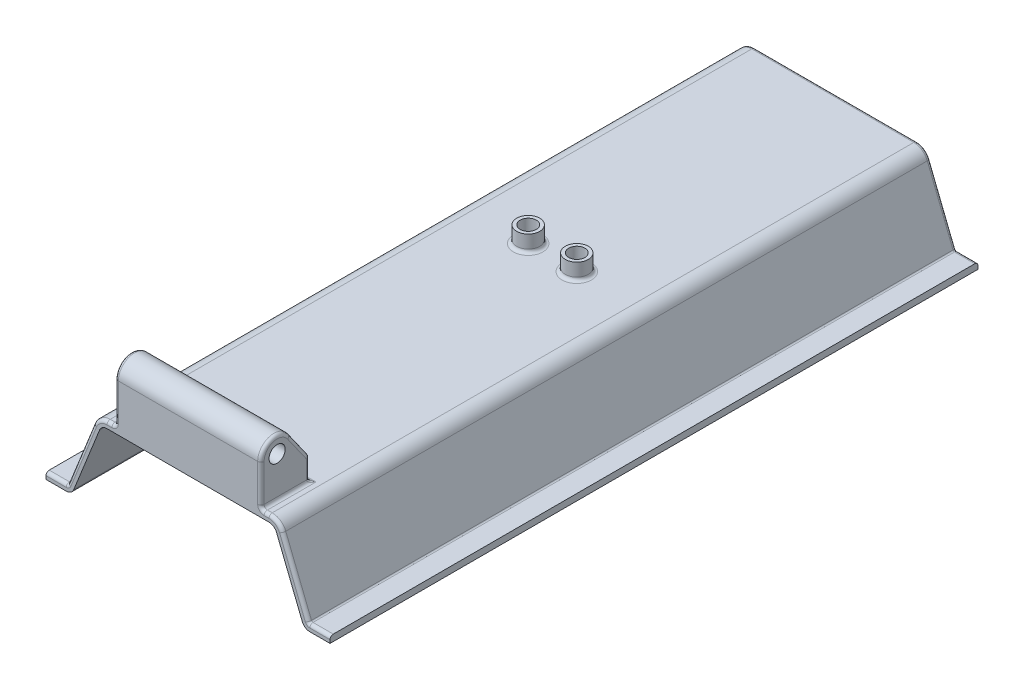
ISO-10303-21;
HEADER;
FILE_DESCRIPTION(('STEP AP214'),'2;1');
FILE_NAME('part.step','',(''),(''),'','','');
FILE_SCHEMA(('AUTOMOTIVE_DESIGN { 1 0 10303 214 1 1 1 1 }'));
ENDSEC;
DATA;
#1=APPLICATION_CONTEXT('core data for automotive mechanical design processes');
#2=APPLICATION_PROTOCOL_DEFINITION('international standard','automotive_design',2000,#1);
#3=PRODUCT_CONTEXT('',#1,'mechanical');
#4=PRODUCT('Part','Part','',(#3));
#5=PRODUCT_RELATED_PRODUCT_CATEGORY('part','',(#4));
#6=PRODUCT_DEFINITION_FORMATION('','',#4);
#7=PRODUCT_DEFINITION_CONTEXT('part definition',#1,'design');
#8=PRODUCT_DEFINITION('design','',#6,#7);
#9=PRODUCT_DEFINITION_SHAPE('','',#8);
#10=(LENGTH_UNIT() NAMED_UNIT(*) SI_UNIT(.MILLI.,.METRE.));
#11=(NAMED_UNIT(*) PLANE_ANGLE_UNIT() SI_UNIT($,.RADIAN.));
#12=(NAMED_UNIT(*) SI_UNIT($,.STERADIAN.) SOLID_ANGLE_UNIT());
#13=UNCERTAINTY_MEASURE_WITH_UNIT(LENGTH_MEASURE(1.E-05),#10,'distance_accuracy_value','');
#14=(GEOMETRIC_REPRESENTATION_CONTEXT(3) GLOBAL_UNCERTAINTY_ASSIGNED_CONTEXT((#13)) GLOBAL_UNIT_ASSIGNED_CONTEXT((#10,
#11,#12)) REPRESENTATION_CONTEXT('',''));
#15=CARTESIAN_POINT('',(0.,0.,0.));
#16=DIRECTION('',(0.,0.,1.));
#17=DIRECTION('',(1.,0.,0.));
#18=AXIS2_PLACEMENT_3D('',#15,#16,#17);
#19=CARTESIAN_POINT('',(-100.,100.,-800.));
#20=DIRECTION('',(0.,1.,0.));
#21=DIRECTION('',(0.,0.,1.));
#22=AXIS2_PLACEMENT_3D('',#19,#20,#21);
#23=PLANE('',#22);
#24=CARTESIAN_POINT('',(-30.0000000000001,100.,-450.));
#25=DIRECTION('',(0.,1.,0.));
#26=DIRECTION('',(0.,0.,1.));
#27=AXIS2_PLACEMENT_3D('',#24,#25,#26);
#28=CIRCLE('',#27,18.142135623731);
#29=CARTESIAN_POINT('',(-30.0000000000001,100.,-431.857864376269));
#30=VERTEX_POINT('',#29);
#31=EDGE_CURVE('E903',#30,#30,#28,.F.);
#32=ORIENTED_EDGE('',*,*,#31,.T.);
#33=EDGE_LOOP('',(#32));
#34=FACE_BOUND('',#33,.T.);
#35=CARTESIAN_POINT('',(29.9999999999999,100.,-450.));
#36=DIRECTION('',(0.,1.,0.));
#37=DIRECTION('',(0.,0.,1.));
#38=AXIS2_PLACEMENT_3D('',#35,#36,#37);
#39=CIRCLE('',#38,18.1421356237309);
#40=CARTESIAN_POINT('',(29.9999999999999,100.,-431.857864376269));
#41=VERTEX_POINT('',#40);
#42=EDGE_CURVE('E886',#41,#41,#39,.F.);
#43=ORIENTED_EDGE('',*,*,#42,.T.);
#44=EDGE_LOOP('',(#43));
#45=FACE_BOUND('',#44,.T.);
#46=DIRECTION('',(0.,0.,1.));
#47=VECTOR('',#46,1.);
#48=CARTESIAN_POINT('',(100.,100.,-800.));
#49=LINE('',#48,#47);
#50=CARTESIAN_POINT('',(100.,100.,-796.));
#51=VERTEX_POINT('',#50);
#52=CARTESIAN_POINT('',(100.,100.,-4.));
#53=VERTEX_POINT('',#52);
#54=EDGE_CURVE('E753',#51,#53,#49,.T.);
#55=ORIENTED_EDGE('',*,*,#54,.F.);
#56=DIRECTION('',(-1.,0.,0.));
#57=VECTOR('',#56,1.);
#58=CARTESIAN_POINT('',(-100.,100.,-796.));
#59=LINE('',#58,#57);
#60=CARTESIAN_POINT('',(-100.,100.,-796.));
#61=VERTEX_POINT('',#60);
#62=EDGE_CURVE('E901',#51,#61,#59,.T.);
#63=ORIENTED_EDGE('',*,*,#62,.T.);
#64=DIRECTION('',(0.,0.,1.));
#65=VECTOR('',#64,1.);
#66=CARTESIAN_POINT('',(-100.,100.,-800.));
#67=LINE('',#66,#65);
#68=CARTESIAN_POINT('',(-100.,100.,-4.));
#69=VERTEX_POINT('',#68);
#70=EDGE_CURVE('E750',#61,#69,#67,.T.);
#71=ORIENTED_EDGE('',*,*,#70,.T.);
#72=DIRECTION('',(-1.,0.,0.));
#73=VECTOR('',#72,1.);
#74=CARTESIAN_POINT('',(-100.,100.,-4.));
#75=LINE('',#74,#73);
#76=CARTESIAN_POINT('',(-94.,100.,-4.));
#77=VERTEX_POINT('',#76);
#78=EDGE_CURVE('E889',#69,#77,#75,.F.);
#79=ORIENTED_EDGE('',*,*,#78,.T.);
#80=DIRECTION('',(0.,0.,-1.));
#81=VECTOR('',#80,1.);
#82=CARTESIAN_POINT('',(-94.,100.,-800.));
#83=LINE('',#82,#81);
#84=CARTESIAN_POINT('',(-94.,100.,-64.0000000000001));
#85=VERTEX_POINT('',#84);
#86=EDGE_CURVE('E891',#77,#85,#83,.T.);
#87=ORIENTED_EDGE('',*,*,#86,.T.);
#88=DIRECTION('',(1.,0.,0.));
#89=VECTOR('',#88,1.);
#90=CARTESIAN_POINT('',(90.,100.,-64.0000000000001));
#91=LINE('',#90,#89);
#92=CARTESIAN_POINT('',(94.,100.,-64.0000000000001));
#93=VERTEX_POINT('',#92);
#94=EDGE_CURVE('E894',#85,#93,#91,.T.);
#95=ORIENTED_EDGE('',*,*,#94,.T.);
#96=DIRECTION('',(0.,0.,-1.));
#97=VECTOR('',#96,1.);
#98=CARTESIAN_POINT('',(94.,100.,0.));
#99=LINE('',#98,#97);
#100=CARTESIAN_POINT('',(94.,100.,-4.));
#101=VERTEX_POINT('',#100);
#102=EDGE_CURVE('E897',#93,#101,#99,.F.);
#103=ORIENTED_EDGE('',*,*,#102,.T.);
#104=DIRECTION('',(-1.,0.,0.));
#105=VECTOR('',#104,1.);
#106=CARTESIAN_POINT('',(-100.,100.,-4.));
#107=LINE('',#106,#105);
#108=EDGE_CURVE('E899',#101,#53,#107,.F.);
#109=ORIENTED_EDGE('',*,*,#108,.T.);
#110=EDGE_LOOP('',(#55,#63,#71,#79,#87,#95,#103,#109));
#111=FACE_BOUND('',#110,.T.);
#112=ADVANCED_FACE('F348',(#34,#45,#111),#23,.T.);
#113=CARTESIAN_POINT('',(-100.,92.,-800.));
#114=DIRECTION('',(0.,-1.,0.));
#115=DIRECTION('',(0.,0.,-1.));
#116=AXIS2_PLACEMENT_3D('',#113,#114,#115);
#117=PLANE('',#116);
#118=CARTESIAN_POINT('',(29.9999999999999,92.,-450.));
#119=DIRECTION('',(0.,-1.,0.));
#120=DIRECTION('',(0.,0.,-1.));
#121=AXIS2_PLACEMENT_3D('',#118,#119,#120);
#122=CIRCLE('',#121,14.1421356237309);
#123=CARTESIAN_POINT('',(29.9999999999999,92.,-464.142135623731));
#124=VERTEX_POINT('',#123);
#125=EDGE_CURVE('E761',#124,#124,#122,.F.);
#126=ORIENTED_EDGE('',*,*,#125,.T.);
#127=EDGE_LOOP('',(#126));
#128=FACE_BOUND('',#127,.T.);
#129=DIRECTION('',(1.,0.,0.));
#130=VECTOR('',#129,1.);
#131=CARTESIAN_POINT('',(-100.,92.,0.));
#132=LINE('',#131,#130);
#133=CARTESIAN_POINT('',(-100.,92.,0.));
#134=VERTEX_POINT('',#133);
#135=CARTESIAN_POINT('',(100.,92.,0.));
#136=VERTEX_POINT('',#135);
#137=EDGE_CURVE('E666',#134,#136,#132,.T.);
#138=ORIENTED_EDGE('',*,*,#137,.F.);
#139=DIRECTION('',(0.,0.,1.));
#140=VECTOR('',#139,1.);
#141=CARTESIAN_POINT('',(-100.,92.,-800.));
#142=LINE('',#141,#140);
#143=CARTESIAN_POINT('',(-100.,92.,-800.));
#144=VERTEX_POINT('',#143);
#145=EDGE_CURVE('E732',#144,#134,#142,.T.);
#146=ORIENTED_EDGE('',*,*,#145,.F.);
#147=DIRECTION('',(1.,0.,0.));
#148=VECTOR('',#147,1.);
#149=CARTESIAN_POINT('',(-100.,92.,-800.));
#150=LINE('',#149,#148);
#151=CARTESIAN_POINT('',(100.,92.,-800.));
#152=VERTEX_POINT('',#151);
#153=EDGE_CURVE('E696',#144,#152,#150,.T.);
#154=ORIENTED_EDGE('',*,*,#153,.T.);
#155=DIRECTION('',(0.,0.,1.));
#156=VECTOR('',#155,1.);
#157=CARTESIAN_POINT('',(100.,92.,-800.));
#158=LINE('',#157,#156);
#159=EDGE_CURVE('E730',#152,#136,#158,.T.);
#160=ORIENTED_EDGE('',*,*,#159,.T.);
#161=EDGE_LOOP('',(#138,#146,#154,#160));
#162=FACE_BOUND('',#161,.T.);
#163=CARTESIAN_POINT('',(-30.0000000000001,92.,-450.));
#164=DIRECTION('',(0.,-1.,0.));
#165=DIRECTION('',(0.,0.,-1.));
#166=AXIS2_PLACEMENT_3D('',#163,#164,#165);
#167=CIRCLE('',#166,14.142135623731);
#168=CARTESIAN_POINT('',(-30.0000000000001,92.,-464.142135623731));
#169=VERTEX_POINT('',#168);
#170=EDGE_CURVE('E766',#169,#169,#167,.F.);
#171=ORIENTED_EDGE('',*,*,#170,.T.);
#172=EDGE_LOOP('',(#171));
#173=FACE_BOUND('',#172,.T.);
#174=ADVANCED_FACE('F1110',(#128,#162,#173),#117,.T.);
#175=CARTESIAN_POINT('',(150.340659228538,9.99999999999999,-800.));
#176=DIRECTION('',(0.,0.,1.));
#177=DIRECTION('',(1.,0.,0.));
#178=AXIS2_PLACEMENT_3D('',#175,#176,#177);
#179=CYLINDRICAL_SURFACE('',#178,2.00000000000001);
#180=DIRECTION('',(0.,0.,1.));
#181=VECTOR('',#180,1.);
#182=CARTESIAN_POINT('',(150.340659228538,7.99999999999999,-800.));
#183=LINE('',#182,#181);
#184=CARTESIAN_POINT('',(150.340659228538,7.99999999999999,-796.));
#185=VERTEX_POINT('',#184);
#186=CARTESIAN_POINT('',(150.340659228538,7.99999999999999,-4.));
#187=VERTEX_POINT('',#186);
#188=EDGE_CURVE('E715',#185,#187,#183,.T.);
#189=ORIENTED_EDGE('',*,*,#188,.F.);
#190=CARTESIAN_POINT('',(150.340659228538,9.99999999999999,-796.));
#191=DIRECTION('',(0.,0.,1.));
#192=DIRECTION('',(1.,0.,0.));
#193=AXIS2_PLACEMENT_3D('',#190,#191,#192);
#194=CIRCLE('',#193,2.00000000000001);
#195=CARTESIAN_POINT('',(148.483705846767,9.25721864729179,-796.));
#196=VERTEX_POINT('',#195);
#197=EDGE_CURVE('E856',#185,#196,#194,.F.);
#198=ORIENTED_EDGE('',*,*,#197,.T.);
#199=DIRECTION('',(0.,0.,1.));
#200=VECTOR('',#199,1.);
#201=CARTESIAN_POINT('',(148.483705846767,9.25721864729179,-800.));
#202=LINE('',#201,#200);
#203=CARTESIAN_POINT('',(148.483705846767,9.25721864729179,-4.));
#204=VERTEX_POINT('',#203);
#205=EDGE_CURVE('E714',#196,#204,#202,.T.);
#206=ORIENTED_EDGE('',*,*,#205,.T.);
#207=CARTESIAN_POINT('',(150.340659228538,9.99999999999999,-4.));
#208=DIRECTION('',(0.,0.,1.));
#209=DIRECTION('',(1.,0.,0.));
#210=AXIS2_PLACEMENT_3D('',#207,#208,#209);
#211=CIRCLE('',#210,2.00000000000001);
#212=EDGE_CURVE('E854',#204,#187,#211,.T.);
#213=ORIENTED_EDGE('',*,*,#212,.T.);
#214=EDGE_LOOP('',(#189,#198,#206,#213));
#215=FACE_BOUND('',#214,.T.);
#216=ADVANCED_FACE('F350',(#215),#179,.F.);
#217=CARTESIAN_POINT('',(150.340659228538,7.99999999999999,-800.));
#218=DIRECTION('',(0.,1.,0.));
#219=DIRECTION('',(-1.,0.,0.));
#220=AXIS2_PLACEMENT_3D('',#217,#218,#219);
#221=PLANE('',#220);
#222=DIRECTION('',(0.,0.,1.));
#223=VECTOR('',#222,1.);
#224=CARTESIAN_POINT('',(175.340659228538,7.99999999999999,-800.));
#225=LINE('',#224,#223);
#226=CARTESIAN_POINT('',(175.340659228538,7.99999999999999,-796.));
#227=VERTEX_POINT('',#226);
#228=CARTESIAN_POINT('',(175.340659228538,7.99999999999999,-4.));
#229=VERTEX_POINT('',#228);
#230=EDGE_CURVE('E719',#227,#229,#225,.T.);
#231=ORIENTED_EDGE('',*,*,#230,.F.);
#232=DIRECTION('',(-1.,0.,0.));
#233=VECTOR('',#232,1.);
#234=CARTESIAN_POINT('',(150.340659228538,7.99999999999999,-796.));
#235=LINE('',#234,#233);
#236=EDGE_CURVE('E829',#227,#185,#235,.T.);
#237=ORIENTED_EDGE('',*,*,#236,.T.);
#238=ORIENTED_EDGE('',*,*,#188,.T.);
#239=DIRECTION('',(-1.,0.,0.));
#240=VECTOR('',#239,1.);
#241=CARTESIAN_POINT('',(150.340659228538,7.99999999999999,-4.));
#242=LINE('',#241,#240);
#243=EDGE_CURVE('E827',#187,#229,#242,.F.);
#244=ORIENTED_EDGE('',*,*,#243,.T.);
#245=EDGE_LOOP('',(#231,#237,#238,#244));
#246=FACE_BOUND('',#245,.T.);
#247=ADVANCED_FACE('F1085',(#246),#221,.T.);
#248=CARTESIAN_POINT('',(175.340659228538,0.,-800.));
#249=DIRECTION('',(1.,0.,0.));
#250=DIRECTION('',(0.,1.,0.));
#251=AXIS2_PLACEMENT_3D('',#248,#249,#250);
#252=PLANE('',#251);
#253=DIRECTION('',(0.,1.,0.));
#254=VECTOR('',#253,1.);
#255=CARTESIAN_POINT('',(175.340659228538,0.,-800.));
#256=LINE('',#255,#254);
#257=CARTESIAN_POINT('',(175.340659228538,0.,-800.));
#258=VERTEX_POINT('',#257);
#259=CARTESIAN_POINT('',(175.340659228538,3.99999999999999,-800.));
#260=VERTEX_POINT('',#259);
#261=EDGE_CURVE('E711',#258,#260,#256,.T.);
#262=ORIENTED_EDGE('',*,*,#261,.T.);
#263=CARTESIAN_POINT('',(175.340659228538,3.99999999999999,-796.));
#264=DIRECTION('',(1.,0.,0.));
#265=DIRECTION('',(0.,1.,0.));
#266=AXIS2_PLACEMENT_3D('',#263,#264,#265);
#267=CIRCLE('',#266,4.);
#268=EDGE_CURVE('E852',#260,#227,#267,.T.);
#269=ORIENTED_EDGE('',*,*,#268,.T.);
#270=ORIENTED_EDGE('',*,*,#230,.T.);
#271=CARTESIAN_POINT('',(175.340659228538,3.99999999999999,-4.));
#272=DIRECTION('',(1.,0.,0.));
#273=DIRECTION('',(0.,1.,0.));
#274=AXIS2_PLACEMENT_3D('',#271,#272,#273);
#275=CIRCLE('',#274,4.);
#276=CARTESIAN_POINT('',(175.340659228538,3.99999999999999,0.));
#277=VERTEX_POINT('',#276);
#278=EDGE_CURVE('E850',#229,#277,#275,.T.);
#279=ORIENTED_EDGE('',*,*,#278,.T.);
#280=DIRECTION('',(0.,1.,0.));
#281=VECTOR('',#280,1.);
#282=CARTESIAN_POINT('',(175.340659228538,0.,0.));
#283=LINE('',#282,#281);
#284=CARTESIAN_POINT('',(175.340659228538,0.,0.));
#285=VERTEX_POINT('',#284);
#286=EDGE_CURVE('E681',#285,#277,#283,.T.);
#287=ORIENTED_EDGE('',*,*,#286,.F.);
#288=DIRECTION('',(0.,0.,1.));
#289=VECTOR('',#288,1.);
#290=CARTESIAN_POINT('',(175.340659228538,0.,-800.));
#291=LINE('',#290,#289);
#292=EDGE_CURVE('E722',#258,#285,#291,.T.);
#293=ORIENTED_EDGE('',*,*,#292,.F.);
#294=EDGE_LOOP('',(#262,#269,#270,#279,#287,#293));
#295=FACE_BOUND('',#294,.T.);
#296=ADVANCED_FACE('F1088',(#295),#252,.T.);
#297=CARTESIAN_POINT('',(150.340659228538,0.,-800.));
#298=DIRECTION('',(0.,-1.,0.));
#299=DIRECTION('',(0.,0.,-1.));
#300=AXIS2_PLACEMENT_3D('',#297,#298,#299);
#301=PLANE('',#300);
#302=DIRECTION('',(1.,0.,0.));
#303=VECTOR('',#302,1.);
#304=CARTESIAN_POINT('',(150.340659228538,0.,0.));
#305=LINE('',#304,#303);
#306=CARTESIAN_POINT('',(150.340659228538,0.,0.));
#307=VERTEX_POINT('',#306);
#308=EDGE_CURVE('E678',#307,#285,#305,.T.);
#309=ORIENTED_EDGE('',*,*,#308,.F.);
#310=DIRECTION('',(0.,0.,1.));
#311=VECTOR('',#310,1.);
#312=CARTESIAN_POINT('',(150.340659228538,0.,-800.));
#313=LINE('',#312,#311);
#314=CARTESIAN_POINT('',(150.340659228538,0.,-800.));
#315=VERTEX_POINT('',#314);
#316=EDGE_CURVE('E724',#315,#307,#313,.T.);
#317=ORIENTED_EDGE('',*,*,#316,.F.);
#318=DIRECTION('',(1.,0.,0.));
#319=VECTOR('',#318,1.);
#320=CARTESIAN_POINT('',(150.340659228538,0.,-800.));
#321=LINE('',#320,#319);
#322=EDGE_CURVE('E708',#315,#258,#321,.T.);
#323=ORIENTED_EDGE('',*,*,#322,.T.);
#324=ORIENTED_EDGE('',*,*,#292,.T.);
#325=EDGE_LOOP('',(#309,#317,#323,#324));
#326=FACE_BOUND('',#325,.T.);
#327=ADVANCED_FACE('F1092',(#326),#301,.T.);
#328=CARTESIAN_POINT('',(150.340659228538,9.99999999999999,-800.));
#329=DIRECTION('',(0.,0.,1.));
#330=DIRECTION('',(1.,0.,0.));
#331=AXIS2_PLACEMENT_3D('',#328,#329,#330);
#332=CYLINDRICAL_SURFACE('',#331,9.99999999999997);
#333=CARTESIAN_POINT('',(150.340659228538,9.99999999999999,0.));
#334=DIRECTION('',(0.,0.,1.));
#335=DIRECTION('',(1.,0.,0.));
#336=AXIS2_PLACEMENT_3D('',#333,#334,#335);
#337=CIRCLE('',#336,9.99999999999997);
#338=CARTESIAN_POINT('',(141.055892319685,6.28609323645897,0.));
#339=VERTEX_POINT('',#338);
#340=EDGE_CURVE('E675',#339,#307,#337,.T.);
#341=ORIENTED_EDGE('',*,*,#340,.F.);
#342=DIRECTION('',(0.,0.,1.));
#343=VECTOR('',#342,1.);
#344=CARTESIAN_POINT('',(141.055892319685,6.28609323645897,-800.));
#345=LINE('',#344,#343);
#346=CARTESIAN_POINT('',(141.055892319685,6.28609323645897,-800.));
#347=VERTEX_POINT('',#346);
#348=EDGE_CURVE('E726',#347,#339,#345,.T.);
#349=ORIENTED_EDGE('',*,*,#348,.F.);
#350=CARTESIAN_POINT('',(150.340659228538,9.99999999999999,-800.));
#351=DIRECTION('',(0.,0.,1.));
#352=DIRECTION('',(1.,0.,0.));
#353=AXIS2_PLACEMENT_3D('',#350,#351,#352);
#354=CIRCLE('',#353,9.99999999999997);
#355=EDGE_CURVE('E705',#347,#315,#354,.T.);
#356=ORIENTED_EDGE('',*,*,#355,.T.);
#357=ORIENTED_EDGE('',*,*,#316,.T.);
#358=EDGE_LOOP('',(#341,#349,#356,#357));
#359=FACE_BOUND('',#358,.T.);
#360=ADVANCED_FACE('F1096',(#359),#332,.T.);
#361=CARTESIAN_POINT('',(109.284766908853,85.7139067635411,-800.));
#362=DIRECTION('',(-0.928476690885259,-0.371390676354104,0.));
#363=DIRECTION('',(0.371390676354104,-0.928476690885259,0.));
#364=AXIS2_PLACEMENT_3D('',#361,#362,#363);
#365=PLANE('',#364);
#366=DIRECTION('',(0.371390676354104,-0.928476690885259,0.));
#367=VECTOR('',#366,1.);
#368=CARTESIAN_POINT('',(109.284766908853,85.7139067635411,0.));
#369=LINE('',#368,#367);
#370=CARTESIAN_POINT('',(109.284766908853,85.7139067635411,0.));
#371=VERTEX_POINT('',#370);
#372=EDGE_CURVE('E672',#371,#339,#369,.T.);
#373=ORIENTED_EDGE('',*,*,#372,.F.);
#374=DIRECTION('',(0.,0.,1.));
#375=VECTOR('',#374,1.);
#376=CARTESIAN_POINT('',(109.284766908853,85.7139067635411,-800.));
#377=LINE('',#376,#375);
#378=CARTESIAN_POINT('',(109.284766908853,85.7139067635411,-800.));
#379=VERTEX_POINT('',#378);
#380=EDGE_CURVE('E728',#379,#371,#377,.T.);
#381=ORIENTED_EDGE('',*,*,#380,.F.);
#382=DIRECTION('',(0.371390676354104,-0.928476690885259,0.));
#383=VECTOR('',#382,1.);
#384=CARTESIAN_POINT('',(109.284766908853,85.7139067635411,-800.));
#385=LINE('',#384,#383);
#386=EDGE_CURVE('E702',#379,#347,#385,.T.);
#387=ORIENTED_EDGE('',*,*,#386,.T.);
#388=ORIENTED_EDGE('',*,*,#348,.T.);
#389=EDGE_LOOP('',(#373,#381,#387,#388));
#390=FACE_BOUND('',#389,.T.);
#391=ADVANCED_FACE('F1100',(#390),#365,.T.);
#392=CARTESIAN_POINT('',(100.,82.,-800.));
#393=DIRECTION('',(0.,0.,1.));
#394=DIRECTION('',(1.,0.,0.));
#395=AXIS2_PLACEMENT_3D('',#392,#393,#394);
#396=CYLINDRICAL_SURFACE('',#395,9.99999999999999);
#397=CARTESIAN_POINT('',(100.,82.,0.));
#398=DIRECTION('',(0.,0.,-1.));
#399=DIRECTION('',(1.,0.,0.));
#400=AXIS2_PLACEMENT_3D('',#397,#398,#399);
#401=CIRCLE('',#400,9.99999999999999);
#402=EDGE_CURVE('E669',#136,#371,#401,.T.);
#403=ORIENTED_EDGE('',*,*,#402,.F.);
#404=ORIENTED_EDGE('',*,*,#159,.F.);
#405=CARTESIAN_POINT('',(100.,82.,-800.));
#406=DIRECTION('',(0.,0.,-1.));
#407=DIRECTION('',(1.,0.,0.));
#408=AXIS2_PLACEMENT_3D('',#405,#406,#407);
#409=CIRCLE('',#408,9.99999999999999);
#410=EDGE_CURVE('E699',#152,#379,#409,.T.);
#411=ORIENTED_EDGE('',*,*,#410,.T.);
#412=ORIENTED_EDGE('',*,*,#380,.T.);
#413=EDGE_LOOP('',(#403,#404,#411,#412));
#414=FACE_BOUND('',#413,.T.);
#415=ADVANCED_FACE('F1104',(#414),#396,.F.);
#416=CARTESIAN_POINT('',(-100.,82.,-800.));
#417=DIRECTION('',(0.,0.,1.));
#418=DIRECTION('',(1.,0.,0.));
#419=AXIS2_PLACEMENT_3D('',#416,#417,#418);
#420=CYLINDRICAL_SURFACE('',#419,9.99999999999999);
#421=CARTESIAN_POINT('',(-100.,82.,0.));
#422=DIRECTION('',(0.,0.,-1.));
#423=DIRECTION('',(-1.,0.,0.));
#424=AXIS2_PLACEMENT_3D('',#421,#422,#423);
#425=CIRCLE('',#424,9.99999999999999);
#426=CARTESIAN_POINT('',(-109.284766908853,85.7139067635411,0.));
#427=VERTEX_POINT('',#426);
#428=EDGE_CURVE('E663',#427,#134,#425,.T.);
#429=ORIENTED_EDGE('',*,*,#428,.F.);
#430=DIRECTION('',(0.,0.,1.));
#431=VECTOR('',#430,1.);
#432=CARTESIAN_POINT('',(-109.284766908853,85.7139067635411,-800.));
#433=LINE('',#432,#431);
#434=CARTESIAN_POINT('',(-109.284766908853,85.7139067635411,-800.));
#435=VERTEX_POINT('',#434);
#436=EDGE_CURVE('E734',#435,#427,#433,.T.);
#437=ORIENTED_EDGE('',*,*,#436,.F.);
#438=CARTESIAN_POINT('',(-100.,82.,-800.));
#439=DIRECTION('',(0.,0.,-1.));
#440=DIRECTION('',(-1.,0.,0.));
#441=AXIS2_PLACEMENT_3D('',#438,#439,#440);
#442=CIRCLE('',#441,9.99999999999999);
#443=EDGE_CURVE('E693',#435,#144,#442,.T.);
#444=ORIENTED_EDGE('',*,*,#443,.T.);
#445=ORIENTED_EDGE('',*,*,#145,.T.);
#446=EDGE_LOOP('',(#429,#437,#444,#445));
#447=FACE_BOUND('',#446,.T.);
#448=ADVANCED_FACE('F1108',(#447),#420,.F.);
#449=CARTESIAN_POINT('',(-109.284766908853,85.7139067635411,-800.));
#450=DIRECTION('',(0.928476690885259,-0.371390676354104,0.));
#451=DIRECTION('',(0.371390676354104,0.928476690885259,0.));
#452=AXIS2_PLACEMENT_3D('',#449,#450,#451);
#453=PLANE('',#452);
#454=DIRECTION('',(0.371390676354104,0.928476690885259,0.));
#455=VECTOR('',#454,1.);
#456=CARTESIAN_POINT('',(-109.284766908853,85.7139067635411,0.));
#457=LINE('',#456,#455);
#458=CARTESIAN_POINT('',(-141.055892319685,6.28609323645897,0.));
#459=VERTEX_POINT('',#458);
#460=EDGE_CURVE('E657',#459,#427,#457,.T.);
#461=ORIENTED_EDGE('',*,*,#460,.F.);
#462=DIRECTION('',(0.,0.,1.));
#463=VECTOR('',#462,1.);
#464=CARTESIAN_POINT('',(-141.055892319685,6.28609323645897,-800.));
#465=LINE('',#464,#463);
#466=CARTESIAN_POINT('',(-141.055892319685,6.28609323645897,-800.));
#467=VERTEX_POINT('',#466);
#468=EDGE_CURVE('E736',#467,#459,#465,.T.);
#469=ORIENTED_EDGE('',*,*,#468,.F.);
#470=DIRECTION('',(0.371390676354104,0.928476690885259,0.));
#471=VECTOR('',#470,1.);
#472=CARTESIAN_POINT('',(-109.284766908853,85.7139067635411,-800.));
#473=LINE('',#472,#471);
#474=EDGE_CURVE('E690',#467,#435,#473,.T.);
#475=ORIENTED_EDGE('',*,*,#474,.T.);
#476=ORIENTED_EDGE('',*,*,#436,.T.);
#477=EDGE_LOOP('',(#461,#469,#475,#476));
#478=FACE_BOUND('',#477,.T.);
#479=ADVANCED_FACE('F1116',(#478),#453,.T.);
#480=CARTESIAN_POINT('',(-150.340659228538,9.99999999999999,-800.));
#481=DIRECTION('',(0.,0.,1.));
#482=DIRECTION('',(1.,0.,0.));
#483=AXIS2_PLACEMENT_3D('',#480,#481,#482);
#484=CYLINDRICAL_SURFACE('',#483,9.99999999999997);
#485=CARTESIAN_POINT('',(-150.340659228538,9.99999999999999,0.));
#486=DIRECTION('',(0.,0.,1.));
#487=DIRECTION('',(-1.,0.,0.));
#488=AXIS2_PLACEMENT_3D('',#485,#486,#487);
#489=CIRCLE('',#488,9.99999999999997);
#490=CARTESIAN_POINT('',(-150.340659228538,0.,0.));
#491=VERTEX_POINT('',#490);
#492=EDGE_CURVE('E655',#491,#459,#489,.T.);
#493=ORIENTED_EDGE('',*,*,#492,.F.);
#494=DIRECTION('',(0.,0.,1.));
#495=VECTOR('',#494,1.);
#496=CARTESIAN_POINT('',(-150.340659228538,0.,-800.));
#497=LINE('',#496,#495);
#498=CARTESIAN_POINT('',(-150.340659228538,0.,-800.));
#499=VERTEX_POINT('',#498);
#500=EDGE_CURVE('E650',#499,#491,#497,.T.);
#501=ORIENTED_EDGE('',*,*,#500,.F.);
#502=CARTESIAN_POINT('',(-150.340659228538,9.99999999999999,-800.));
#503=DIRECTION('',(0.,0.,1.));
#504=DIRECTION('',(-1.,0.,0.));
#505=AXIS2_PLACEMENT_3D('',#502,#503,#504);
#506=CIRCLE('',#505,9.99999999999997);
#507=EDGE_CURVE('E687',#499,#467,#506,.T.);
#508=ORIENTED_EDGE('',*,*,#507,.T.);
#509=ORIENTED_EDGE('',*,*,#468,.T.);
#510=EDGE_LOOP('',(#493,#501,#508,#509));
#511=FACE_BOUND('',#510,.T.);
#512=ADVANCED_FACE('F1120',(#511),#484,.T.);
#513=CARTESIAN_POINT('',(-150.340659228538,0.,-800.));
#514=DIRECTION('',(0.,-1.,0.));
#515=DIRECTION('',(0.,0.,-1.));
#516=AXIS2_PLACEMENT_3D('',#513,#514,#515);
#517=PLANE('',#516);
#518=DIRECTION('',(1.,0.,0.));
#519=VECTOR('',#518,1.);
#520=CARTESIAN_POINT('',(-150.340659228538,0.,0.));
#521=LINE('',#520,#519);
#522=CARTESIAN_POINT('',(-175.340659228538,0.,0.));
#523=VERTEX_POINT('',#522);
#524=EDGE_CURVE('E634',#523,#491,#521,.T.);
#525=ORIENTED_EDGE('',*,*,#524,.F.);
#526=DIRECTION('',(0.,0.,1.));
#527=VECTOR('',#526,1.);
#528=CARTESIAN_POINT('',(-175.340659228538,0.,-800.));
#529=LINE('',#528,#527);
#530=CARTESIAN_POINT('',(-175.340659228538,0.,-800.));
#531=VERTEX_POINT('',#530);
#532=EDGE_CURVE('E642',#531,#523,#529,.T.);
#533=ORIENTED_EDGE('',*,*,#532,.F.);
#534=DIRECTION('',(1.,0.,0.));
#535=VECTOR('',#534,1.);
#536=CARTESIAN_POINT('',(-150.340659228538,0.,-800.));
#537=LINE('',#536,#535);
#538=EDGE_CURVE('E685',#531,#499,#537,.T.);
#539=ORIENTED_EDGE('',*,*,#538,.T.);
#540=ORIENTED_EDGE('',*,*,#500,.T.);
#541=EDGE_LOOP('',(#525,#533,#539,#540));
#542=FACE_BOUND('',#541,.T.);
#543=ADVANCED_FACE('F653',(#542),#517,.T.);
#544=CARTESIAN_POINT('',(-175.340659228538,0.,-800.));
#545=DIRECTION('',(-1.,0.,0.));
#546=DIRECTION('',(0.,-1.,0.));
#547=AXIS2_PLACEMENT_3D('',#544,#545,#546);
#548=PLANE('',#547);
#549=DIRECTION('',(0.,0.,1.));
#550=VECTOR('',#549,1.);
#551=CARTESIAN_POINT('',(-175.340659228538,7.99999999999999,-800.));
#552=LINE('',#551,#550);
#553=CARTESIAN_POINT('',(-175.340659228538,7.99999999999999,-796.));
#554=VERTEX_POINT('',#553);
#555=CARTESIAN_POINT('',(-175.340659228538,7.99999999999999,-4.));
#556=VERTEX_POINT('',#555);
#557=EDGE_CURVE('E651',#554,#556,#552,.T.);
#558=ORIENTED_EDGE('',*,*,#557,.F.);
#559=CARTESIAN_POINT('',(-175.340659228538,3.99999999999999,-796.));
#560=DIRECTION('',(-1.,0.,0.));
#561=DIRECTION('',(0.,-1.,0.));
#562=AXIS2_PLACEMENT_3D('',#559,#560,#561);
#563=CIRCLE('',#562,4.);
#564=CARTESIAN_POINT('',(-175.340659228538,3.99999999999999,-800.));
#565=VERTEX_POINT('',#564);
#566=EDGE_CURVE('E872',#554,#565,#563,.T.);
#567=ORIENTED_EDGE('',*,*,#566,.T.);
#568=DIRECTION('',(0.,-1.,0.));
#569=VECTOR('',#568,1.);
#570=CARTESIAN_POINT('',(-175.340659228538,0.,-800.));
#571=LINE('',#570,#569);
#572=EDGE_CURVE('E646',#565,#531,#571,.T.);
#573=ORIENTED_EDGE('',*,*,#572,.T.);
#574=ORIENTED_EDGE('',*,*,#532,.T.);
#575=DIRECTION('',(0.,-1.,0.));
#576=VECTOR('',#575,1.);
#577=CARTESIAN_POINT('',(-175.340659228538,0.,0.));
#578=LINE('',#577,#576);
#579=CARTESIAN_POINT('',(-175.340659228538,3.99999999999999,0.));
#580=VERTEX_POINT('',#579);
#581=EDGE_CURVE('E629',#580,#523,#578,.T.);
#582=ORIENTED_EDGE('',*,*,#581,.F.);
#583=CARTESIAN_POINT('',(-175.340659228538,3.99999999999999,-4.));
#584=DIRECTION('',(-1.,0.,0.));
#585=DIRECTION('',(0.,-1.,0.));
#586=AXIS2_PLACEMENT_3D('',#583,#584,#585);
#587=CIRCLE('',#586,4.);
#588=EDGE_CURVE('E870',#580,#556,#587,.T.);
#589=ORIENTED_EDGE('',*,*,#588,.T.);
#590=EDGE_LOOP('',(#558,#567,#573,#574,#582,#589));
#591=FACE_BOUND('',#590,.T.);
#592=ADVANCED_FACE('F644',(#591),#548,.T.);
#593=CARTESIAN_POINT('',(-150.340659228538,7.99999999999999,-800.));
#594=DIRECTION('',(0.,1.,0.));
#595=DIRECTION('',(-1.,0.,0.));
#596=AXIS2_PLACEMENT_3D('',#593,#594,#595);
#597=PLANE('',#596);
#598=DIRECTION('',(0.,0.,1.));
#599=VECTOR('',#598,1.);
#600=CARTESIAN_POINT('',(-150.340659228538,7.99999999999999,-800.));
#601=LINE('',#600,#599);
#602=CARTESIAN_POINT('',(-150.340659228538,7.99999999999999,-796.));
#603=VERTEX_POINT('',#602);
#604=CARTESIAN_POINT('',(-150.340659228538,7.99999999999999,-4.));
#605=VERTEX_POINT('',#604);
#606=EDGE_CURVE('E741',#603,#605,#601,.T.);
#607=ORIENTED_EDGE('',*,*,#606,.F.);
#608=DIRECTION('',(-1.,0.,0.));
#609=VECTOR('',#608,1.);
#610=CARTESIAN_POINT('',(-175.340659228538,7.99999999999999,-796.));
#611=LINE('',#610,#609);
#612=EDGE_CURVE('E868',#603,#554,#611,.T.);
#613=ORIENTED_EDGE('',*,*,#612,.T.);
#614=ORIENTED_EDGE('',*,*,#557,.T.);
#615=DIRECTION('',(-1.,0.,0.));
#616=VECTOR('',#615,1.);
#617=CARTESIAN_POINT('',(-150.340659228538,7.99999999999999,-4.));
#618=LINE('',#617,#616);
#619=EDGE_CURVE('E866',#556,#605,#618,.F.);
#620=ORIENTED_EDGE('',*,*,#619,.T.);
#621=EDGE_LOOP('',(#607,#613,#614,#620));
#622=FACE_BOUND('',#621,.T.);
#623=ADVANCED_FACE('F1129',(#622),#597,.T.);
#624=CARTESIAN_POINT('',(-150.340659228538,9.99999999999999,-800.));
#625=DIRECTION('',(0.,0.,1.));
#626=DIRECTION('',(1.,0.,0.));
#627=AXIS2_PLACEMENT_3D('',#624,#625,#626);
#628=CYLINDRICAL_SURFACE('',#627,2.00000000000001);
#629=DIRECTION('',(0.,0.,1.));
#630=VECTOR('',#629,1.);
#631=CARTESIAN_POINT('',(-148.483705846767,9.25721864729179,-800.));
#632=LINE('',#631,#630);
#633=CARTESIAN_POINT('',(-148.483705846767,9.25721864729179,-796.));
#634=VERTEX_POINT('',#633);
#635=CARTESIAN_POINT('',(-148.483705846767,9.25721864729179,-4.));
#636=VERTEX_POINT('',#635);
#637=EDGE_CURVE('E744',#634,#636,#632,.T.);
#638=ORIENTED_EDGE('',*,*,#637,.F.);
#639=CARTESIAN_POINT('',(-150.340659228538,9.99999999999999,-796.));
#640=DIRECTION('',(0.,0.,1.));
#641=DIRECTION('',(1.,0.,0.));
#642=AXIS2_PLACEMENT_3D('',#639,#640,#641);
#643=CIRCLE('',#642,2.00000000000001);
#644=EDGE_CURVE('E876',#634,#603,#643,.F.);
#645=ORIENTED_EDGE('',*,*,#644,.T.);
#646=ORIENTED_EDGE('',*,*,#606,.T.);
#647=CARTESIAN_POINT('',(-150.340659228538,9.99999999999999,-4.));
#648=DIRECTION('',(0.,0.,1.));
#649=DIRECTION('',(1.,0.,0.));
#650=AXIS2_PLACEMENT_3D('',#647,#648,#649);
#651=CIRCLE('',#650,2.00000000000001);
#652=EDGE_CURVE('E874',#605,#636,#651,.T.);
#653=ORIENTED_EDGE('',*,*,#652,.T.);
#654=EDGE_LOOP('',(#638,#645,#646,#653));
#655=FACE_BOUND('',#654,.T.);
#656=ADVANCED_FACE('F1132',(#655),#628,.F.);
#657=CARTESIAN_POINT('',(-116.712580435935,88.6850321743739,-800.));
#658=DIRECTION('',(-0.928476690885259,0.371390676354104,0.));
#659=DIRECTION('',(-0.371390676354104,-0.92847669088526,0.));
#660=AXIS2_PLACEMENT_3D('',#657,#658,#659);
#661=PLANE('',#660);
#662=DIRECTION('',(0.,0.,1.));
#663=VECTOR('',#662,1.);
#664=CARTESIAN_POINT('',(-116.712580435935,88.6850321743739,-800.));
#665=LINE('',#664,#663);
#666=CARTESIAN_POINT('',(-116.712580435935,88.6850321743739,-796.));
#667=VERTEX_POINT('',#666);
#668=CARTESIAN_POINT('',(-116.712580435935,88.6850321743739,-4.));
#669=VERTEX_POINT('',#668);
#670=EDGE_CURVE('E747',#667,#669,#665,.T.);
#671=ORIENTED_EDGE('',*,*,#670,.F.);
#672=DIRECTION('',(-0.371390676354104,-0.92847669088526,0.));
#673=VECTOR('',#672,1.);
#674=CARTESIAN_POINT('',(-148.483705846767,9.25721864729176,-796.));
#675=LINE('',#674,#673);
#676=EDGE_CURVE('E880',#667,#634,#675,.T.);
#677=ORIENTED_EDGE('',*,*,#676,.T.);
#678=ORIENTED_EDGE('',*,*,#637,.T.);
#679=DIRECTION('',(-0.371390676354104,-0.92847669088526,0.));
#680=VECTOR('',#679,1.);
#681=CARTESIAN_POINT('',(-116.712580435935,88.6850321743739,-4.));
#682=LINE('',#681,#680);
#683=EDGE_CURVE('E878',#636,#669,#682,.F.);
#684=ORIENTED_EDGE('',*,*,#683,.T.);
#685=EDGE_LOOP('',(#671,#677,#678,#684));
#686=FACE_BOUND('',#685,.T.);
#687=ADVANCED_FACE('F1136',(#686),#661,.T.);
#688=CARTESIAN_POINT('',(-100.,82.,-800.));
#689=DIRECTION('',(0.,0.,1.));
#690=DIRECTION('',(1.,0.,0.));
#691=AXIS2_PLACEMENT_3D('',#688,#689,#690);
#692=CYLINDRICAL_SURFACE('',#691,18.);
#693=ORIENTED_EDGE('',*,*,#70,.F.);
#694=CARTESIAN_POINT('',(-100.,82.,-796.));
#695=DIRECTION('',(0.,0.,1.));
#696=DIRECTION('',(1.,0.,0.));
#697=AXIS2_PLACEMENT_3D('',#694,#695,#696);
#698=CIRCLE('',#697,18.);
#699=EDGE_CURVE('E884',#61,#667,#698,.T.);
#700=ORIENTED_EDGE('',*,*,#699,.T.);
#701=ORIENTED_EDGE('',*,*,#670,.T.);
#702=CARTESIAN_POINT('',(-100.,82.,-4.));
#703=DIRECTION('',(0.,0.,1.));
#704=DIRECTION('',(1.,0.,0.));
#705=AXIS2_PLACEMENT_3D('',#702,#703,#704);
#706=CIRCLE('',#705,18.);
#707=EDGE_CURVE('E882',#669,#69,#706,.F.);
#708=ORIENTED_EDGE('',*,*,#707,.T.);
#709=EDGE_LOOP('',(#693,#700,#701,#708));
#710=FACE_BOUND('',#709,.T.);
#711=ADVANCED_FACE('F1140',(#710),#692,.T.);
#712=CARTESIAN_POINT('',(100.,82.,-800.));
#713=DIRECTION('',(0.,0.,1.));
#714=DIRECTION('',(1.,0.,0.));
#715=AXIS2_PLACEMENT_3D('',#712,#713,#714);
#716=CYLINDRICAL_SURFACE('',#715,18.);
#717=DIRECTION('',(0.,0.,1.));
#718=VECTOR('',#717,1.);
#719=CARTESIAN_POINT('',(116.712580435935,88.6850321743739,-800.));
#720=LINE('',#719,#718);
#721=CARTESIAN_POINT('',(116.712580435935,88.6850321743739,-796.));
#722=VERTEX_POINT('',#721);
#723=CARTESIAN_POINT('',(116.712580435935,88.6850321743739,-4.));
#724=VERTEX_POINT('',#723);
#725=EDGE_CURVE('E756',#722,#724,#720,.T.);
#726=ORIENTED_EDGE('',*,*,#725,.F.);
#727=CARTESIAN_POINT('',(100.,82.,-796.));
#728=DIRECTION('',(0.,0.,1.));
#729=DIRECTION('',(1.,0.,0.));
#730=AXIS2_PLACEMENT_3D('',#727,#728,#729);
#731=CIRCLE('',#730,18.);
#732=EDGE_CURVE('E864',#722,#51,#731,.T.);
#733=ORIENTED_EDGE('',*,*,#732,.T.);
#734=ORIENTED_EDGE('',*,*,#54,.T.);
#735=CARTESIAN_POINT('',(100.,82.,-4.));
#736=DIRECTION('',(0.,0.,1.));
#737=DIRECTION('',(1.,0.,0.));
#738=AXIS2_PLACEMENT_3D('',#735,#736,#737);
#739=CIRCLE('',#738,18.);
#740=EDGE_CURVE('E862',#53,#724,#739,.F.);
#741=ORIENTED_EDGE('',*,*,#740,.T.);
#742=EDGE_LOOP('',(#726,#733,#734,#741));
#743=FACE_BOUND('',#742,.T.);
#744=ADVANCED_FACE('F1144',(#743),#716,.T.);
#745=CARTESIAN_POINT('',(116.712580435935,88.6850321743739,-800.));
#746=DIRECTION('',(0.928476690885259,0.371390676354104,0.));
#747=DIRECTION('',(-0.371390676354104,0.92847669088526,0.));
#748=AXIS2_PLACEMENT_3D('',#745,#746,#747);
#749=PLANE('',#748);
#750=ORIENTED_EDGE('',*,*,#205,.F.);
#751=DIRECTION('',(-0.371390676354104,0.92847669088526,0.));
#752=VECTOR('',#751,1.);
#753=CARTESIAN_POINT('',(116.712580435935,88.6850321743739,-796.));
#754=LINE('',#753,#752);
#755=EDGE_CURVE('E860',#196,#722,#754,.T.);
#756=ORIENTED_EDGE('',*,*,#755,.T.);
#757=ORIENTED_EDGE('',*,*,#725,.T.);
#758=DIRECTION('',(-0.371390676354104,0.92847669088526,0.));
#759=VECTOR('',#758,1.);
#760=CARTESIAN_POINT('',(116.712580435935,88.6850321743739,-4.));
#761=LINE('',#760,#759);
#762=EDGE_CURVE('E858',#724,#204,#761,.F.);
#763=ORIENTED_EDGE('',*,*,#762,.T.);
#764=EDGE_LOOP('',(#750,#756,#757,#763));
#765=FACE_BOUND('',#764,.T.);
#766=ADVANCED_FACE('F1083',(#765),#749,.T.);
#767=CARTESIAN_POINT('',(150.340659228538,9.99999999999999,-800.));
#768=DIRECTION('',(0.,0.,1.));
#769=DIRECTION('',(1.,0.,0.));
#770=AXIS2_PLACEMENT_3D('',#767,#768,#769);
#771=PLANE('',#770);
#772=CARTESIAN_POINT('',(150.340659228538,9.99999999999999,-800.));
#773=DIRECTION('',(0.,0.,1.));
#774=DIRECTION('',(1.,0.,0.));
#775=AXIS2_PLACEMENT_3D('',#772,#773,#774);
#776=CIRCLE('',#775,6.00000000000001);
#777=CARTESIAN_POINT('',(144.769799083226,7.77165594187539,-800.));
#778=VERTEX_POINT('',#777);
#779=CARTESIAN_POINT('',(150.340659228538,3.99999999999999,-800.));
#780=VERTEX_POINT('',#779);
#781=EDGE_CURVE('E846',#778,#780,#776,.T.);
#782=ORIENTED_EDGE('',*,*,#781,.T.);
#783=DIRECTION('',(-1.,0.,0.));
#784=VECTOR('',#783,1.);
#785=CARTESIAN_POINT('',(175.340659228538,3.99999999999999,-800.));
#786=LINE('',#785,#784);
#787=EDGE_CURVE('E848',#780,#260,#786,.F.);
#788=ORIENTED_EDGE('',*,*,#787,.T.);
#789=ORIENTED_EDGE('',*,*,#261,.F.);
#790=ORIENTED_EDGE('',*,*,#322,.F.);
#791=ORIENTED_EDGE('',*,*,#355,.F.);
#792=ORIENTED_EDGE('',*,*,#386,.F.);
#793=ORIENTED_EDGE('',*,*,#410,.F.);
#794=ORIENTED_EDGE('',*,*,#153,.F.);
#795=ORIENTED_EDGE('',*,*,#443,.F.);
#796=ORIENTED_EDGE('',*,*,#474,.F.);
#797=ORIENTED_EDGE('',*,*,#507,.F.);
#798=ORIENTED_EDGE('',*,*,#538,.F.);
#799=ORIENTED_EDGE('',*,*,#572,.F.);
#800=DIRECTION('',(-1.,0.,0.));
#801=VECTOR('',#800,1.);
#802=CARTESIAN_POINT('',(-150.340659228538,3.99999999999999,-800.));
#803=LINE('',#802,#801);
#804=CARTESIAN_POINT('',(-150.340659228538,3.99999999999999,-800.));
#805=VERTEX_POINT('',#804);
#806=EDGE_CURVE('E840',#565,#805,#803,.F.);
#807=ORIENTED_EDGE('',*,*,#806,.T.);
#808=CARTESIAN_POINT('',(-150.340659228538,9.99999999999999,-800.));
#809=DIRECTION('',(0.,0.,1.));
#810=DIRECTION('',(1.,0.,0.));
#811=AXIS2_PLACEMENT_3D('',#808,#809,#810);
#812=CIRCLE('',#811,6.00000000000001);
#813=CARTESIAN_POINT('',(-144.769799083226,7.77165594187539,-800.));
#814=VERTEX_POINT('',#813);
#815=EDGE_CURVE('E838',#805,#814,#812,.T.);
#816=ORIENTED_EDGE('',*,*,#815,.T.);
#817=DIRECTION('',(-0.371390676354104,-0.92847669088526,0.));
#818=VECTOR('',#817,1.);
#819=CARTESIAN_POINT('',(-112.998673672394,87.1994694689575,-800.));
#820=LINE('',#819,#818);
#821=CARTESIAN_POINT('',(-112.998673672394,87.1994694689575,-800.));
#822=VERTEX_POINT('',#821);
#823=EDGE_CURVE('E836',#814,#822,#820,.F.);
#824=ORIENTED_EDGE('',*,*,#823,.T.);
#825=CARTESIAN_POINT('',(-100.,82.,-800.));
#826=DIRECTION('',(0.,0.,1.));
#827=DIRECTION('',(1.,0.,0.));
#828=AXIS2_PLACEMENT_3D('',#825,#826,#827);
#829=CIRCLE('',#828,14.);
#830=CARTESIAN_POINT('',(-100.,96.,-800.));
#831=VERTEX_POINT('',#830);
#832=EDGE_CURVE('E834',#822,#831,#829,.F.);
#833=ORIENTED_EDGE('',*,*,#832,.T.);
#834=DIRECTION('',(-1.,0.,0.));
#835=VECTOR('',#834,1.);
#836=CARTESIAN_POINT('',(100.,96.,-800.));
#837=LINE('',#836,#835);
#838=CARTESIAN_POINT('',(100.,96.,-800.));
#839=VERTEX_POINT('',#838);
#840=EDGE_CURVE('E832',#831,#839,#837,.F.);
#841=ORIENTED_EDGE('',*,*,#840,.T.);
#842=CARTESIAN_POINT('',(100.,82.,-800.));
#843=DIRECTION('',(0.,0.,1.));
#844=DIRECTION('',(1.,0.,0.));
#845=AXIS2_PLACEMENT_3D('',#842,#843,#844);
#846=CIRCLE('',#845,14.);
#847=CARTESIAN_POINT('',(112.998673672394,87.1994694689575,-800.));
#848=VERTEX_POINT('',#847);
#849=EDGE_CURVE('E842',#839,#848,#846,.F.);
#850=ORIENTED_EDGE('',*,*,#849,.T.);
#851=DIRECTION('',(-0.371390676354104,0.92847669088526,0.));
#852=VECTOR('',#851,1.);
#853=CARTESIAN_POINT('',(144.769799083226,7.77165594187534,-800.));
#854=LINE('',#853,#852);
#855=EDGE_CURVE('E844',#848,#778,#854,.F.);
#856=ORIENTED_EDGE('',*,*,#855,.T.);
#857=EDGE_LOOP('',(#782,#788,#789,#790,#791,#792,#793,#794,#795,#796,#797,#798,#799,#807,#816,
#824,#833,#841,#850,#856));
#858=FACE_BOUND('',#857,.T.);
#859=ADVANCED_FACE('F1080',(#858),#771,.F.);
#860=CARTESIAN_POINT('',(150.340659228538,9.99999999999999,0.));
#861=DIRECTION('',(0.,0.,1.));
#862=DIRECTION('',(1.,0.,0.));
#863=AXIS2_PLACEMENT_3D('',#860,#861,#862);
#864=PLANE('',#863);
#865=CARTESIAN_POINT('',(94.,104.,0.));
#866=DIRECTION('',(0.,0.,1.));
#867=DIRECTION('',(1.,0.,0.));
#868=AXIS2_PLACEMENT_3D('',#865,#866,#867);
#869=CIRCLE('',#868,8.);
#870=CARTESIAN_POINT('',(86.,104.,0.));
#871=VERTEX_POINT('',#870);
#872=CARTESIAN_POINT('',(94.,96.,0.));
#873=VERTEX_POINT('',#872);
#874=EDGE_CURVE('E812',#871,#873,#869,.T.);
#875=ORIENTED_EDGE('',*,*,#874,.F.);
#876=DIRECTION('',(0.,-1.,0.));
#877=VECTOR('',#876,1.);
#878=CARTESIAN_POINT('',(86.,9.99999999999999,0.));
#879=LINE('',#878,#877);
#880=CARTESIAN_POINT('',(85.9999999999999,150.,0.));
#881=VERTEX_POINT('',#880);
#882=EDGE_CURVE('E825',#871,#881,#879,.F.);
#883=ORIENTED_EDGE('',*,*,#882,.T.);
#884=DIRECTION('',(1.,0.,0.));
#885=VECTOR('',#884,1.);
#886=CARTESIAN_POINT('',(-90.,150.,0.));
#887=LINE('',#886,#885);
#888=CARTESIAN_POINT('',(-86.,150.,0.));
#889=VERTEX_POINT('',#888);
#890=EDGE_CURVE('E639',#889,#881,#887,.T.);
#891=ORIENTED_EDGE('',*,*,#890,.F.);
#892=DIRECTION('',(0.,-1.,0.));
#893=VECTOR('',#892,1.);
#894=CARTESIAN_POINT('',(-86.,100.,0.));
#895=LINE('',#894,#893);
#896=CARTESIAN_POINT('',(-86.,104.,0.));
#897=VERTEX_POINT('',#896);
#898=EDGE_CURVE('E810',#889,#897,#895,.T.);
#899=ORIENTED_EDGE('',*,*,#898,.T.);
#900=CARTESIAN_POINT('',(-94.,104.,0.));
#901=DIRECTION('',(0.,0.,1.));
#902=DIRECTION('',(1.,0.,0.));
#903=AXIS2_PLACEMENT_3D('',#900,#901,#902);
#904=CIRCLE('',#903,8.);
#905=CARTESIAN_POINT('',(-94.,96.,0.));
#906=VERTEX_POINT('',#905);
#907=EDGE_CURVE('E807',#906,#897,#904,.T.);
#908=ORIENTED_EDGE('',*,*,#907,.F.);
#909=DIRECTION('',(-1.,0.,0.));
#910=VECTOR('',#909,1.);
#911=CARTESIAN_POINT('',(150.340659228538,96.,0.));
#912=LINE('',#911,#910);
#913=CARTESIAN_POINT('',(-100.,96.,0.));
#914=VERTEX_POINT('',#913);
#915=EDGE_CURVE('E798',#906,#914,#912,.T.);
#916=ORIENTED_EDGE('',*,*,#915,.T.);
#917=CARTESIAN_POINT('',(-100.,82.,0.));
#918=DIRECTION('',(0.,0.,1.));
#919=DIRECTION('',(1.,0.,0.));
#920=AXIS2_PLACEMENT_3D('',#917,#918,#919);
#921=CIRCLE('',#920,14.);
#922=CARTESIAN_POINT('',(-112.998673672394,87.1994694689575,0.));
#923=VERTEX_POINT('',#922);
#924=EDGE_CURVE('E800',#914,#923,#921,.T.);
#925=ORIENTED_EDGE('',*,*,#924,.T.);
#926=DIRECTION('',(-0.371390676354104,-0.92847669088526,0.));
#927=VECTOR('',#926,1.);
#928=CARTESIAN_POINT('',(-103.296513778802,111.454869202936,0.));
#929=LINE('',#928,#927);
#930=CARTESIAN_POINT('',(-144.769799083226,7.7716559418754,0.));
#931=VERTEX_POINT('',#930);
#932=EDGE_CURVE('E802',#923,#931,#929,.T.);
#933=ORIENTED_EDGE('',*,*,#932,.T.);
#934=CARTESIAN_POINT('',(-150.340659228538,9.99999999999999,0.));
#935=DIRECTION('',(0.,0.,1.));
#936=DIRECTION('',(1.,0.,0.));
#937=AXIS2_PLACEMENT_3D('',#934,#935,#936);
#938=CIRCLE('',#937,6.00000000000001);
#939=CARTESIAN_POINT('',(-150.340659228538,3.99999999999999,0.));
#940=VERTEX_POINT('',#939);
#941=EDGE_CURVE('E804',#931,#940,#938,.F.);
#942=ORIENTED_EDGE('',*,*,#941,.T.);
#943=DIRECTION('',(-1.,0.,0.));
#944=VECTOR('',#943,1.);
#945=CARTESIAN_POINT('',(150.340659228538,3.99999999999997,0.));
#946=LINE('',#945,#944);
#947=EDGE_CURVE('E636',#940,#580,#946,.T.);
#948=ORIENTED_EDGE('',*,*,#947,.T.);
#949=ORIENTED_EDGE('',*,*,#581,.T.);
#950=ORIENTED_EDGE('',*,*,#524,.T.);
#951=ORIENTED_EDGE('',*,*,#492,.T.);
#952=ORIENTED_EDGE('',*,*,#460,.T.);
#953=ORIENTED_EDGE('',*,*,#428,.T.);
#954=ORIENTED_EDGE('',*,*,#137,.T.);
#955=ORIENTED_EDGE('',*,*,#402,.T.);
#956=ORIENTED_EDGE('',*,*,#372,.T.);
#957=ORIENTED_EDGE('',*,*,#340,.T.);
#958=ORIENTED_EDGE('',*,*,#308,.T.);
#959=ORIENTED_EDGE('',*,*,#286,.T.);
#960=DIRECTION('',(-1.,0.,0.));
#961=VECTOR('',#960,1.);
#962=CARTESIAN_POINT('',(150.340659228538,3.99999999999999,0.));
#963=LINE('',#962,#961);
#964=CARTESIAN_POINT('',(150.340659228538,3.99999999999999,0.));
#965=VERTEX_POINT('',#964);
#966=EDGE_CURVE('E823',#277,#965,#963,.T.);
#967=ORIENTED_EDGE('',*,*,#966,.T.);
#968=CARTESIAN_POINT('',(150.340659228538,9.99999999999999,0.));
#969=DIRECTION('',(0.,0.,1.));
#970=DIRECTION('',(1.,0.,0.));
#971=AXIS2_PLACEMENT_3D('',#968,#969,#970);
#972=CIRCLE('',#971,6.00000000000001);
#973=CARTESIAN_POINT('',(144.769799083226,7.7716559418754,0.));
#974=VERTEX_POINT('',#973);
#975=EDGE_CURVE('E821',#965,#974,#972,.F.);
#976=ORIENTED_EDGE('',*,*,#975,.T.);
#977=DIRECTION('',(-0.371390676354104,0.92847669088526,0.));
#978=VECTOR('',#977,1.);
#979=CARTESIAN_POINT('',(144.769799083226,7.77165594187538,0.));
#980=LINE('',#979,#978);
#981=CARTESIAN_POINT('',(112.998673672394,87.1994694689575,0.));
#982=VERTEX_POINT('',#981);
#983=EDGE_CURVE('E819',#974,#982,#980,.T.);
#984=ORIENTED_EDGE('',*,*,#983,.T.);
#985=CARTESIAN_POINT('',(100.,82.,0.));
#986=DIRECTION('',(0.,0.,1.));
#987=DIRECTION('',(1.,0.,0.));
#988=AXIS2_PLACEMENT_3D('',#985,#986,#987);
#989=CIRCLE('',#988,14.);
#990=CARTESIAN_POINT('',(100.,96.,0.));
#991=VERTEX_POINT('',#990);
#992=EDGE_CURVE('E817',#982,#991,#989,.T.);
#993=ORIENTED_EDGE('',*,*,#992,.T.);
#994=DIRECTION('',(-1.,0.,0.));
#995=VECTOR('',#994,1.);
#996=CARTESIAN_POINT('',(150.340659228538,96.,0.));
#997=LINE('',#996,#995);
#998=EDGE_CURVE('E815',#991,#873,#997,.T.);
#999=ORIENTED_EDGE('',*,*,#998,.T.);
#1000=EDGE_LOOP('',(#875,#883,#891,#899,#908,#916,#925,#933,#942,#948,#949,#950,#951,#952,#953,
#954,#955,#956,#957,#958,#959,#967,#976,#984,#993,#999));
#1001=FACE_BOUND('',#1000,.T.);
#1002=ADVANCED_FACE('F631',(#1001),#864,.T.);
#1003=CARTESIAN_POINT('',(-90.,150.,-20.));
#1004=DIRECTION('',(1.,0.,0.));
#1005=DIRECTION('',(0.,0.,-1.));
#1006=AXIS2_PLACEMENT_3D('',#1003,#1004,#1005);
#1007=CYLINDRICAL_SURFACE('',#1006,20.);
#1008=ORIENTED_EDGE('',*,*,#890,.T.);
#1009=CARTESIAN_POINT('',(86.,150.,-20.));
#1010=DIRECTION('',(1.,0.,0.));
#1011=DIRECTION('',(0.,0.,-1.));
#1012=AXIS2_PLACEMENT_3D('',#1009,#1010,#1011);
#1013=CIRCLE('',#1012,20.);
#1014=CARTESIAN_POINT('',(85.9999999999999,161.528996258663,-36.3426511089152));
#1015=VERTEX_POINT('',#1014);
#1016=EDGE_CURVE('E796',#881,#1015,#1013,.F.);
#1017=ORIENTED_EDGE('',*,*,#1016,.T.);
#1018=DIRECTION('',(1.,0.,0.));
#1019=VECTOR('',#1018,1.);
#1020=CARTESIAN_POINT('',(-90.,161.528996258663,-36.3426511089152));
#1021=LINE('',#1020,#1019);
#1022=CARTESIAN_POINT('',(-86.,161.528996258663,-36.3426511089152));
#1023=VERTEX_POINT('',#1022);
#1024=EDGE_CURVE('E1275',#1023,#1015,#1021,.T.);
#1025=ORIENTED_EDGE('',*,*,#1024,.F.);
#1026=CARTESIAN_POINT('',(-86.,150.,-20.));
#1027=DIRECTION('',(1.,0.,0.));
#1028=DIRECTION('',(0.,0.,-1.));
#1029=AXIS2_PLACEMENT_3D('',#1026,#1027,#1028);
#1030=CIRCLE('',#1029,20.);
#1031=EDGE_CURVE('E794',#1023,#889,#1030,.T.);
#1032=ORIENTED_EDGE('',*,*,#1031,.T.);
#1033=EDGE_LOOP('',(#1008,#1017,#1025,#1032));
#1034=FACE_BOUND('',#1033,.T.);
#1035=ADVANCED_FACE('F1061',(#1034),#1007,.T.);
#1036=CARTESIAN_POINT('',(-90.,127.99409084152,-60.));
#1037=DIRECTION('',(0.,0.576449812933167,-0.817132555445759));
#1038=DIRECTION('',(0.,0.817132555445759,0.576449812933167));
#1039=AXIS2_PLACEMENT_3D('',#1036,#1037,#1038);
#1040=PLANE('',#1039);
#1041=DIRECTION('',(0.,0.817132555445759,0.576449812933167));
#1042=VECTOR('',#1041,1.);
#1043=CARTESIAN_POINT('',(86.,127.99409084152,-60.));
#1044=LINE('',#1043,#1042);
#1045=CARTESIAN_POINT('',(86.,129.030968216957,-59.268530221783));
#1046=VERTEX_POINT('',#1045);
#1047=EDGE_CURVE('E780',#1015,#1046,#1044,.F.);
#1048=ORIENTED_EDGE('',*,*,#1047,.T.);
#1049=DIRECTION('',(1.,0.,0.));
#1050=VECTOR('',#1049,1.);
#1051=CARTESIAN_POINT('',(-90.,129.030968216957,-59.268530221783));
#1052=LINE('',#1051,#1050);
#1053=CARTESIAN_POINT('',(-86.,129.030968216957,-59.268530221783));
#1054=VERTEX_POINT('',#1053);
#1055=EDGE_CURVE('E11',#1046,#1054,#1052,.F.);
#1056=ORIENTED_EDGE('',*,*,#1055,.T.);
#1057=DIRECTION('',(0.,0.817132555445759,0.576449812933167));
#1058=VECTOR('',#1057,1.);
#1059=CARTESIAN_POINT('',(-86.,161.528996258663,-36.3426511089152));
#1060=LINE('',#1059,#1058);
#1061=EDGE_CURVE('E778',#1054,#1023,#1060,.T.);
#1062=ORIENTED_EDGE('',*,*,#1061,.T.);
#1063=ORIENTED_EDGE('',*,*,#1024,.T.);
#1064=EDGE_LOOP('',(#1048,#1056,#1062,#1063));
#1065=FACE_BOUND('',#1064,.T.);
#1066=ADVANCED_FACE('F1064',(#1065),#1040,.T.);
#1067=CARTESIAN_POINT('',(-90.,100.,-60.));
#1068=DIRECTION('',(0.,0.,-1.));
#1069=DIRECTION('',(-1.,0.,0.));
#1070=AXIS2_PLACEMENT_3D('',#1067,#1068,#1069);
#1071=PLANE('',#1070);
#1072=DIRECTION('',(1.,0.,0.));
#1073=VECTOR('',#1072,1.);
#1074=CARTESIAN_POINT('',(-90.,104.,-60.));
#1075=LINE('',#1074,#1073);
#1076=CARTESIAN_POINT('',(86.,104.,-60.));
#1077=VERTEX_POINT('',#1076);
#1078=CARTESIAN_POINT('',(-86.,104.,-60.));
#1079=VERTEX_POINT('',#1078);
#1080=EDGE_CURVE('E782',#1077,#1079,#1075,.F.);
#1081=ORIENTED_EDGE('',*,*,#1080,.T.);
#1082=DIRECTION('',(0.,1.,0.));
#1083=VECTOR('',#1082,1.);
#1084=CARTESIAN_POINT('',(-86.,121.055065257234,-60.));
#1085=LINE('',#1084,#1083);
#1086=CARTESIAN_POINT('',(-86.,126.725168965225,-60.));
#1087=VERTEX_POINT('',#1086);
#1088=EDGE_CURVE('E927',#1079,#1087,#1085,.T.);
#1089=ORIENTED_EDGE('',*,*,#1088,.T.);
#1090=DIRECTION('',(1.,0.,0.));
#1091=VECTOR('',#1090,1.);
#1092=CARTESIAN_POINT('',(-90.,126.725168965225,-60.));
#1093=LINE('',#1092,#1091);
#1094=CARTESIAN_POINT('',(86.,126.725168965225,-60.));
#1095=VERTEX_POINT('',#1094);
#1096=EDGE_CURVE('E923',#1087,#1095,#1093,.T.);
#1097=ORIENTED_EDGE('',*,*,#1096,.T.);
#1098=DIRECTION('',(0.,1.,0.));
#1099=VECTOR('',#1098,1.);
#1100=CARTESIAN_POINT('',(86.,100.,-60.));
#1101=LINE('',#1100,#1099);
#1102=EDGE_CURVE('E925',#1095,#1077,#1101,.F.);
#1103=ORIENTED_EDGE('',*,*,#1102,.T.);
#1104=EDGE_LOOP('',(#1081,#1089,#1097,#1103));
#1105=FACE_BOUND('',#1104,.T.);
#1106=ADVANCED_FACE('F1059',(#1105),#1071,.T.);
#1107=CARTESIAN_POINT('',(-90.,150.,-20.));
#1108=DIRECTION('',(1.,0.,0.));
#1109=DIRECTION('',(0.,0.,-1.));
#1110=AXIS2_PLACEMENT_3D('',#1107,#1108,#1109);
#1111=PLANE('',#1110);
#1112=CARTESIAN_POINT('',(-90.,150.,-20.));
#1113=DIRECTION('',(1.,0.,0.));
#1114=DIRECTION('',(0.,0.,-1.));
#1115=AXIS2_PLACEMENT_3D('',#1112,#1113,#1114);
#1116=CIRCLE('',#1115,10.);
#1117=CARTESIAN_POINT('',(-90.,150.,-30.));
#1118=VERTEX_POINT('',#1117);
#1119=EDGE_CURVE('E1272',#1118,#1118,#1116,.T.);
#1120=ORIENTED_EDGE('',*,*,#1119,.T.);
#1121=EDGE_LOOP('',(#1120));
#1122=FACE_BOUND('',#1121,.T.);
#1123=DIRECTION('',(0.,0.817132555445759,0.576449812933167));
#1124=VECTOR('',#1123,1.);
#1125=CARTESIAN_POINT('',(-90.,125.688291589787,-56.731469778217));
#1126=LINE('',#1125,#1124);
#1127=CARTESIAN_POINT('',(-90.,159.223197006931,-33.0741208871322));
#1128=VERTEX_POINT('',#1127);
#1129=CARTESIAN_POINT('',(-90.,126.725168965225,-56.));
#1130=VERTEX_POINT('',#1129);
#1131=EDGE_CURVE('E791',#1128,#1130,#1126,.F.);
#1132=ORIENTED_EDGE('',*,*,#1131,.T.);
#1133=DIRECTION('',(0.,1.,0.));
#1134=VECTOR('',#1133,1.);
#1135=CARTESIAN_POINT('',(-90.,104.,-56.));
#1136=LINE('',#1135,#1134);
#1137=CARTESIAN_POINT('',(-90.,104.,-56.));
#1138=VERTEX_POINT('',#1137);
#1139=EDGE_CURVE('E929',#1130,#1138,#1136,.F.);
#1140=ORIENTED_EDGE('',*,*,#1139,.T.);
#1141=DIRECTION('',(0.,0.,-1.));
#1142=VECTOR('',#1141,1.);
#1143=CARTESIAN_POINT('',(-90.,104.,-20.));
#1144=LINE('',#1143,#1142);
#1145=CARTESIAN_POINT('',(-90.,104.,-4.));
#1146=VERTEX_POINT('',#1145);
#1147=EDGE_CURVE('E785',#1138,#1146,#1144,.F.);
#1148=ORIENTED_EDGE('',*,*,#1147,.T.);
#1149=DIRECTION('',(0.,-1.,0.));
#1150=VECTOR('',#1149,1.);
#1151=CARTESIAN_POINT('',(-90.,150.,-4.));
#1152=LINE('',#1151,#1150);
#1153=CARTESIAN_POINT('',(-90.,150.,-4.));
#1154=VERTEX_POINT('',#1153);
#1155=EDGE_CURVE('E787',#1146,#1154,#1152,.F.);
#1156=ORIENTED_EDGE('',*,*,#1155,.T.);
#1157=CARTESIAN_POINT('',(-90.,150.,-20.));
#1158=DIRECTION('',(1.,0.,0.));
#1159=DIRECTION('',(0.,0.,-1.));
#1160=AXIS2_PLACEMENT_3D('',#1157,#1158,#1159);
#1161=CIRCLE('',#1160,16.);
#1162=EDGE_CURVE('E789',#1154,#1128,#1161,.F.);
#1163=ORIENTED_EDGE('',*,*,#1162,.T.);
#1164=EDGE_LOOP('',(#1132,#1140,#1148,#1156,#1163));
#1165=FACE_BOUND('',#1164,.T.);
#1166=ADVANCED_FACE('F934',(#1122,#1165),#1111,.F.);
#1167=CARTESIAN_POINT('',(90.,150.,-20.));
#1168=DIRECTION('',(1.,0.,0.));
#1169=DIRECTION('',(0.,0.,-1.));
#1170=AXIS2_PLACEMENT_3D('',#1167,#1168,#1169);
#1171=PLANE('',#1170);
#1172=CARTESIAN_POINT('',(90.,150.,-20.));
#1173=DIRECTION('',(1.,0.,0.));
#1174=DIRECTION('',(0.,0.,-1.));
#1175=AXIS2_PLACEMENT_3D('',#1172,#1173,#1174);
#1176=CIRCLE('',#1175,10.);
#1177=CARTESIAN_POINT('',(90.,150.,-30.));
#1178=VERTEX_POINT('',#1177);
#1179=EDGE_CURVE('E764',#1178,#1178,#1176,.T.);
#1180=ORIENTED_EDGE('',*,*,#1179,.F.);
#1181=EDGE_LOOP('',(#1180));
#1182=FACE_BOUND('',#1181,.T.);
#1183=DIRECTION('',(0.,0.,-1.));
#1184=VECTOR('',#1183,1.);
#1185=CARTESIAN_POINT('',(90.,104.,-60.));
#1186=LINE('',#1185,#1184);
#1187=CARTESIAN_POINT('',(90.,104.,-4.));
#1188=VERTEX_POINT('',#1187);
#1189=CARTESIAN_POINT('',(90.,104.,-56.));
#1190=VERTEX_POINT('',#1189);
#1191=EDGE_CURVE('E718',#1188,#1190,#1186,.T.);
#1192=ORIENTED_EDGE('',*,*,#1191,.T.);
#1193=DIRECTION('',(0.,1.,0.));
#1194=VECTOR('',#1193,1.);
#1195=CARTESIAN_POINT('',(90.,150.,-56.));
#1196=LINE('',#1195,#1194);
#1197=CARTESIAN_POINT('',(90.,126.725168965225,-56.));
#1198=VERTEX_POINT('',#1197);
#1199=EDGE_CURVE('E370',#1190,#1198,#1196,.T.);
#1200=ORIENTED_EDGE('',*,*,#1199,.T.);
#1201=DIRECTION('',(0.,0.817132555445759,0.576449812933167));
#1202=VECTOR('',#1201,1.);
#1203=CARTESIAN_POINT('',(90.,159.223197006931,-33.0741208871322));
#1204=LINE('',#1203,#1202);
#1205=CARTESIAN_POINT('',(90.,159.223197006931,-33.0741208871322));
#1206=VERTEX_POINT('',#1205);
#1207=EDGE_CURVE('E776',#1198,#1206,#1204,.T.);
#1208=ORIENTED_EDGE('',*,*,#1207,.T.);
#1209=CARTESIAN_POINT('',(90.,150.,-20.));
#1210=DIRECTION('',(1.,0.,0.));
#1211=DIRECTION('',(0.,0.,-1.));
#1212=AXIS2_PLACEMENT_3D('',#1209,#1210,#1211);
#1213=CIRCLE('',#1212,16.);
#1214=CARTESIAN_POINT('',(90.,150.,-4.));
#1215=VERTEX_POINT('',#1214);
#1216=EDGE_CURVE('E774',#1206,#1215,#1213,.T.);
#1217=ORIENTED_EDGE('',*,*,#1216,.T.);
#1218=DIRECTION('',(0.,-1.,0.));
#1219=VECTOR('',#1218,1.);
#1220=CARTESIAN_POINT('',(90.,150.,-4.));
#1221=LINE('',#1220,#1219);
#1222=EDGE_CURVE('E772',#1215,#1188,#1221,.T.);
#1223=ORIENTED_EDGE('',*,*,#1222,.T.);
#1224=EDGE_LOOP('',(#1192,#1200,#1208,#1217,#1223));
#1225=FACE_BOUND('',#1224,.T.);
#1226=ADVANCED_FACE('F1052',(#1182,#1225),#1171,.T.);
#1227=CARTESIAN_POINT('',(-90.,150.,-20.));
#1228=DIRECTION('',(1.,0.,0.));
#1229=DIRECTION('',(0.,0.,-1.));
#1230=AXIS2_PLACEMENT_3D('',#1227,#1228,#1229);
#1231=CYLINDRICAL_SURFACE('',#1230,10.);
#1232=CARTESIAN_POINT('',(-90.,150.,-30.));
#1233=CARTESIAN_POINT('',(-88.125,150.,-30.));
#1234=CARTESIAN_POINT('',(-86.25,150.,-30.));
#1235=CARTESIAN_POINT('',(-82.5,150.,-30.));
#1236=CARTESIAN_POINT('',(-80.625,150.,-30.));
#1237=CARTESIAN_POINT('',(-76.875,150.,-30.));
#1238=CARTESIAN_POINT('',(-75.,150.,-30.));
#1239=CARTESIAN_POINT('',(-71.25,150.,-30.));
#1240=CARTESIAN_POINT('',(-69.375,150.,-30.));
#1241=CARTESIAN_POINT('',(-65.625,150.,-30.));
#1242=CARTESIAN_POINT('',(-63.75,150.,-30.));
#1243=CARTESIAN_POINT('',(-60.,150.,-30.));
#1244=CARTESIAN_POINT('',(-58.125,150.,-30.));
#1245=CARTESIAN_POINT('',(-54.375,150.,-30.));
#1246=CARTESIAN_POINT('',(-52.5,150.,-30.));
#1247=CARTESIAN_POINT('',(-48.75,150.,-30.));
#1248=CARTESIAN_POINT('',(-46.875,150.,-30.));
#1249=CARTESIAN_POINT('',(-43.125,150.,-30.));
#1250=CARTESIAN_POINT('',(-41.25,150.,-30.));
#1251=CARTESIAN_POINT('',(-37.5,150.,-30.));
#1252=CARTESIAN_POINT('',(-35.625,150.,-30.));
#1253=CARTESIAN_POINT('',(-31.875,150.,-30.));
#1254=CARTESIAN_POINT('',(-30.,150.,-30.));
#1255=CARTESIAN_POINT('',(-26.25,150.,-30.));
#1256=CARTESIAN_POINT('',(-24.375,150.,-30.));
#1257=CARTESIAN_POINT('',(-20.625,150.,-30.));
#1258=CARTESIAN_POINT('',(-18.75,150.,-30.));
#1259=CARTESIAN_POINT('',(-15.,150.,-30.));
#1260=CARTESIAN_POINT('',(-13.125,150.,-30.));
#1261=CARTESIAN_POINT('',(-9.37500000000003,150.,-30.));
#1262=CARTESIAN_POINT('',(-7.50000000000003,150.,-30.));
#1263=CARTESIAN_POINT('',(-3.75000000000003,150.,-30.));
#1264=CARTESIAN_POINT('',(-1.87500000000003,150.,-30.));
#1265=CARTESIAN_POINT('',(1.87499999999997,150.,-30.));
#1266=CARTESIAN_POINT('',(3.74999999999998,150.,-30.));
#1267=CARTESIAN_POINT('',(7.49999999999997,150.,-30.));
#1268=CARTESIAN_POINT('',(9.37499999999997,150.,-30.));
#1269=CARTESIAN_POINT('',(13.125,150.,-30.));
#1270=CARTESIAN_POINT('',(15.,150.,-30.));
#1271=CARTESIAN_POINT('',(18.75,150.,-30.));
#1272=CARTESIAN_POINT('',(20.625,150.,-30.));
#1273=CARTESIAN_POINT('',(24.375,150.,-30.));
#1274=CARTESIAN_POINT('',(26.25,150.,-30.));
#1275=CARTESIAN_POINT('',(30.,150.,-30.));
#1276=CARTESIAN_POINT('',(31.875,150.,-30.));
#1277=CARTESIAN_POINT('',(35.625,150.,-30.));
#1278=CARTESIAN_POINT('',(37.5,150.,-30.));
#1279=CARTESIAN_POINT('',(41.25,150.,-30.));
#1280=CARTESIAN_POINT('',(43.125,150.,-30.));
#1281=CARTESIAN_POINT('',(46.875,150.,-30.));
#1282=CARTESIAN_POINT('',(48.75,150.,-30.));
#1283=CARTESIAN_POINT('',(52.5,150.,-30.));
#1284=CARTESIAN_POINT('',(54.375,150.,-30.));
#1285=CARTESIAN_POINT('',(58.125,150.,-30.));
#1286=CARTESIAN_POINT('',(60.,150.,-30.));
#1287=CARTESIAN_POINT('',(63.75,150.,-30.));
#1288=CARTESIAN_POINT('',(65.625,150.,-30.));
#1289=CARTESIAN_POINT('',(69.375,150.,-30.));
#1290=CARTESIAN_POINT('',(71.25,150.,-30.));
#1291=CARTESIAN_POINT('',(75.,150.,-30.));
#1292=CARTESIAN_POINT('',(76.875,150.,-30.));
#1293=CARTESIAN_POINT('',(80.625,150.,-30.));
#1294=CARTESIAN_POINT('',(82.5,150.,-30.));
#1295=CARTESIAN_POINT('',(86.25,150.,-30.));
#1296=CARTESIAN_POINT('',(88.125,150.,-30.));
#1297=CARTESIAN_POINT('',(90.,150.,-30.));
#1298=B_SPLINE_CURVE_WITH_KNOTS('',3,(#1232,#1233,#1234,#1235,#1236,#1237,#1238,#1239,#1240,
#1241,#1242,#1243,#1244,#1245,#1246,#1247,#1248,#1249,#1250,#1251,#1252,#1253,#1254,#1255,#1256,
#1257,#1258,#1259,#1260,#1261,#1262,#1263,#1264,#1265,#1266,#1267,#1268,#1269,#1270,#1271,#1272,
#1273,#1274,#1275,#1276,#1277,#1278,#1279,#1280,#1281,#1282,#1283,#1284,#1285,#1286,#1287,#1288,
#1289,#1290,#1291,#1292,#1293,#1294,#1295,#1296,#1297),.UNSPECIFIED.,.F.,.F.,(4,2,2,2,2,2,2,2,2,
2,2,2,2,2,2,2,2,2,2,2,2,2,2,2,2,2,2,2,2,2,2,2,4),(0.,5.62500000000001,11.25,16.875,22.5,28.125,
33.75,39.375,45.,50.625,56.25,61.875,67.5,73.125,78.75,84.375,90.,95.625,101.25,106.875,112.5,
118.125,123.75,129.375,135.,140.625,146.25,151.875,157.5,163.125,168.75,174.375,180.),.UNSPECIFIED.);
#1299=EDGE_CURVE('BSEAM1048',#1118,#1178,#1298,.T.);
#1300=ORIENTED_EDGE('',*,*,#1119,.F.);
#1301=ORIENTED_EDGE('',*,*,#1179,.T.);
#1302=ORIENTED_EDGE('',*,*,#1299,.T.);
#1303=ORIENTED_EDGE('',*,*,#1299,.F.);
#1304=EDGE_LOOP('',(#1300,#1302,#1301,#1303));
#1305=FACE_BOUND('',#1304,.T.);
#1306=ADVANCED_FACE('F1048',(#1305),#1231,.F.);
#1307=CARTESIAN_POINT('',(29.9999999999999,120.,-450.));
#1308=DIRECTION('',(0.,-1.,0.));
#1309=DIRECTION('',(0.,0.,-1.));
#1310=AXIS2_PLACEMENT_3D('',#1307,#1308,#1309);
#1311=CYLINDRICAL_SURFACE('',#1310,14.1421356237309);
#1312=ORIENTED_EDGE('',*,*,#125,.F.);
#1313=EDGE_LOOP('',(#1312));
#1314=FACE_BOUND('',#1313,.T.);
#1315=CARTESIAN_POINT('',(29.9999999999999,80.,-450.));
#1316=DIRECTION('',(0.,1.,0.));
#1317=DIRECTION('',(0.,0.,1.));
#1318=AXIS2_PLACEMENT_3D('',#1315,#1316,#1317);
#1319=CIRCLE('',#1318,14.1421356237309);
#1320=CARTESIAN_POINT('',(29.9999999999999,80.,-435.857864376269));
#1321=VERTEX_POINT('',#1320);
#1322=EDGE_CURVE('E1265',#1321,#1321,#1319,.T.);
#1323=ORIENTED_EDGE('',*,*,#1322,.T.);
#1324=EDGE_LOOP('',(#1323));
#1325=FACE_BOUND('',#1324,.T.);
#1326=ADVANCED_FACE('F1040',(#1314,#1325),#1311,.T.);
#1327=CARTESIAN_POINT('',(29.9999999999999,80.,-450.));
#1328=DIRECTION('',(0.,1.,0.));
#1329=DIRECTION('',(0.,0.,1.));
#1330=AXIS2_PLACEMENT_3D('',#1327,#1328,#1329);
#1331=PLANE('',#1330);
#1332=ORIENTED_EDGE('',*,*,#1322,.F.);
#1333=EDGE_LOOP('',(#1332));
#1334=FACE_BOUND('',#1333,.T.);
#1335=CARTESIAN_POINT('',(29.9999999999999,80.,-450.));
#1336=DIRECTION('',(0.,1.,0.));
#1337=DIRECTION('',(0.,0.,1.));
#1338=AXIS2_PLACEMENT_3D('',#1335,#1336,#1337);
#1339=CIRCLE('',#1338,10.);
#1340=CARTESIAN_POINT('',(29.9999999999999,80.,-440.));
#1341=VERTEX_POINT('',#1340);
#1342=EDGE_CURVE('E769',#1341,#1341,#1339,.T.);
#1343=ORIENTED_EDGE('',*,*,#1342,.T.);
#1344=EDGE_LOOP('',(#1343));
#1345=FACE_BOUND('',#1344,.T.);
#1346=ADVANCED_FACE('F1036',(#1334,#1345),#1331,.F.);
#1347=CARTESIAN_POINT('',(29.9999999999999,104.,-450.));
#1348=DIRECTION('',(0.,1.,0.));
#1349=DIRECTION('',(0.,0.,1.));
#1350=AXIS2_PLACEMENT_3D('',#1347,#1348,#1349);
#1351=CIRCLE('',#1350,14.1421356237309);
#1352=CARTESIAN_POINT('',(29.9999999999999,104.,-435.857864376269));
#1353=VERTEX_POINT('',#1352);
#1354=EDGE_CURVE('E909',#1353,#1353,#1351,.T.);
#1355=ORIENTED_EDGE('',*,*,#1354,.T.);
#1356=EDGE_LOOP('',(#1355));
#1357=FACE_BOUND('',#1356,.T.);
#1358=CARTESIAN_POINT('',(29.9999999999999,120.,-450.));
#1359=DIRECTION('',(0.,1.,0.));
#1360=DIRECTION('',(0.,0.,1.));
#1361=AXIS2_PLACEMENT_3D('',#1358,#1359,#1360);
#1362=CIRCLE('',#1361,14.1421356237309);
#1363=CARTESIAN_POINT('',(29.9999999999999,120.,-435.857864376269));
#1364=VERTEX_POINT('',#1363);
#1365=EDGE_CURVE('E765',#1364,#1364,#1362,.T.);
#1366=ORIENTED_EDGE('',*,*,#1365,.F.);
#1367=EDGE_LOOP('',(#1366));
#1368=FACE_BOUND('',#1367,.T.);
#1369=ADVANCED_FACE('F1039',(#1357,#1368),#1311,.T.);
#1370=CARTESIAN_POINT('',(29.9999999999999,120.,-450.));
#1371=DIRECTION('',(0.,1.,0.));
#1372=DIRECTION('',(0.,0.,1.));
#1373=AXIS2_PLACEMENT_3D('',#1370,#1371,#1372);
#1374=PLANE('',#1373);
#1375=ORIENTED_EDGE('',*,*,#1365,.T.);
#1376=EDGE_LOOP('',(#1375));
#1377=FACE_BOUND('',#1376,.T.);
#1378=CARTESIAN_POINT('',(29.9999999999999,120.,-450.));
#1379=DIRECTION('',(0.,1.,0.));
#1380=DIRECTION('',(0.,0.,1.));
#1381=AXIS2_PLACEMENT_3D('',#1378,#1379,#1380);
#1382=CIRCLE('',#1381,10.);
#1383=CARTESIAN_POINT('',(29.9999999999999,120.,-440.));
#1384=VERTEX_POINT('',#1383);
#1385=EDGE_CURVE('E1262',#1384,#1384,#1382,.T.);
#1386=ORIENTED_EDGE('',*,*,#1385,.F.);
#1387=EDGE_LOOP('',(#1386));
#1388=FACE_BOUND('',#1387,.T.);
#1389=ADVANCED_FACE('F1042',(#1377,#1388),#1374,.T.);
#1390=CARTESIAN_POINT('',(29.9999999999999,0.,-450.));
#1391=DIRECTION('',(0.,1.,0.));
#1392=DIRECTION('',(0.,0.,1.));
#1393=AXIS2_PLACEMENT_3D('',#1390,#1391,#1392);
#1394=CYLINDRICAL_SURFACE('',#1393,10.);
#1395=ORIENTED_EDGE('',*,*,#1342,.F.);
#1396=EDGE_LOOP('',(#1395));
#1397=FACE_BOUND('',#1396,.T.);
#1398=ORIENTED_EDGE('',*,*,#1385,.T.);
#1399=EDGE_LOOP('',(#1398));
#1400=FACE_BOUND('',#1399,.T.);
#1401=ADVANCED_FACE('F1034',(#1397,#1400),#1394,.F.);
#1402=CARTESIAN_POINT('',(-30.0000000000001,120.,-450.));
#1403=DIRECTION('',(0.,-1.,0.));
#1404=DIRECTION('',(0.,0.,-1.));
#1405=AXIS2_PLACEMENT_3D('',#1402,#1403,#1404);
#1406=CYLINDRICAL_SURFACE('',#1405,14.142135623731);
#1407=ORIENTED_EDGE('',*,*,#170,.F.);
#1408=EDGE_LOOP('',(#1407));
#1409=FACE_BOUND('',#1408,.T.);
#1410=CARTESIAN_POINT('',(-30.0000000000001,80.,-450.));
#1411=DIRECTION('',(0.,1.,0.));
#1412=DIRECTION('',(0.,0.,1.));
#1413=AXIS2_PLACEMENT_3D('',#1410,#1411,#1412);
#1414=CIRCLE('',#1413,14.142135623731);
#1415=CARTESIAN_POINT('',(-30.0000000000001,80.,-435.857864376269));
#1416=VERTEX_POINT('',#1415);
#1417=EDGE_CURVE('E1255',#1416,#1416,#1414,.T.);
#1418=ORIENTED_EDGE('',*,*,#1417,.T.);
#1419=EDGE_LOOP('',(#1418));
#1420=FACE_BOUND('',#1419,.T.);
#1421=ADVANCED_FACE('F1026',(#1409,#1420),#1406,.T.);
#1422=CARTESIAN_POINT('',(-30.0000000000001,80.,-450.));
#1423=DIRECTION('',(0.,1.,0.));
#1424=DIRECTION('',(0.,0.,1.));
#1425=AXIS2_PLACEMENT_3D('',#1422,#1423,#1424);
#1426=PLANE('',#1425);
#1427=ORIENTED_EDGE('',*,*,#1417,.F.);
#1428=EDGE_LOOP('',(#1427));
#1429=FACE_BOUND('',#1428,.T.);
#1430=CARTESIAN_POINT('',(-30.0000000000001,80.,-450.));
#1431=DIRECTION('',(0.,1.,0.));
#1432=DIRECTION('',(0.,0.,1.));
#1433=AXIS2_PLACEMENT_3D('',#1430,#1431,#1432);
#1434=CIRCLE('',#1433,10.);
#1435=CARTESIAN_POINT('',(-30.0000000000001,80.,-440.));
#1436=VERTEX_POINT('',#1435);
#1437=EDGE_CURVE('E1249',#1436,#1436,#1434,.T.);
#1438=ORIENTED_EDGE('',*,*,#1437,.T.);
#1439=EDGE_LOOP('',(#1438));
#1440=FACE_BOUND('',#1439,.T.);
#1441=ADVANCED_FACE('F1022',(#1429,#1440),#1426,.F.);
#1442=CARTESIAN_POINT('',(-30.0000000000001,104.,-450.));
#1443=DIRECTION('',(0.,1.,0.));
#1444=DIRECTION('',(0.,0.,1.));
#1445=AXIS2_PLACEMENT_3D('',#1442,#1443,#1444);
#1446=CIRCLE('',#1445,14.142135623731);
#1447=CARTESIAN_POINT('',(-30.0000000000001,104.,-435.857864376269));
#1448=VERTEX_POINT('',#1447);
#1449=EDGE_CURVE('E906',#1448,#1448,#1446,.T.);
#1450=ORIENTED_EDGE('',*,*,#1449,.T.);
#1451=EDGE_LOOP('',(#1450));
#1452=FACE_BOUND('',#1451,.T.);
#1453=CARTESIAN_POINT('',(-30.0000000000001,120.,-450.));
#1454=DIRECTION('',(0.,1.,0.));
#1455=DIRECTION('',(0.,0.,1.));
#1456=AXIS2_PLACEMENT_3D('',#1453,#1454,#1455);
#1457=CIRCLE('',#1456,14.142135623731);
#1458=CARTESIAN_POINT('',(-30.0000000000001,120.,-435.857864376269));
#1459=VERTEX_POINT('',#1458);
#1460=EDGE_CURVE('E770',#1459,#1459,#1457,.T.);
#1461=ORIENTED_EDGE('',*,*,#1460,.F.);
#1462=EDGE_LOOP('',(#1461));
#1463=FACE_BOUND('',#1462,.T.);
#1464=ADVANCED_FACE('F1025',(#1452,#1463),#1406,.T.);
#1465=CARTESIAN_POINT('',(-30.0000000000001,120.,-450.));
#1466=DIRECTION('',(0.,1.,0.));
#1467=DIRECTION('',(0.,0.,1.));
#1468=AXIS2_PLACEMENT_3D('',#1465,#1466,#1467);
#1469=PLANE('',#1468);
#1470=ORIENTED_EDGE('',*,*,#1460,.T.);
#1471=EDGE_LOOP('',(#1470));
#1472=FACE_BOUND('',#1471,.T.);
#1473=CARTESIAN_POINT('',(-30.0000000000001,120.,-450.));
#1474=DIRECTION('',(0.,1.,0.));
#1475=DIRECTION('',(0.,0.,1.));
#1476=AXIS2_PLACEMENT_3D('',#1473,#1474,#1475);
#1477=CIRCLE('',#1476,10.);
#1478=CARTESIAN_POINT('',(-30.0000000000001,120.,-440.));
#1479=VERTEX_POINT('',#1478);
#1480=EDGE_CURVE('E1252',#1479,#1479,#1477,.T.);
#1481=ORIENTED_EDGE('',*,*,#1480,.F.);
#1482=EDGE_LOOP('',(#1481));
#1483=FACE_BOUND('',#1482,.T.);
#1484=ADVANCED_FACE('F1028',(#1472,#1483),#1469,.T.);
#1485=CARTESIAN_POINT('',(-30.0000000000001,0.,-450.));
#1486=DIRECTION('',(0.,1.,0.));
#1487=DIRECTION('',(0.,0.,1.));
#1488=AXIS2_PLACEMENT_3D('',#1485,#1486,#1487);
#1489=CYLINDRICAL_SURFACE('',#1488,10.);
#1490=ORIENTED_EDGE('',*,*,#1437,.F.);
#1491=EDGE_LOOP('',(#1490));
#1492=FACE_BOUND('',#1491,.T.);
#1493=ORIENTED_EDGE('',*,*,#1480,.T.);
#1494=EDGE_LOOP('',(#1493));
#1495=FACE_BOUND('',#1494,.T.);
#1496=ADVANCED_FACE('F1020',(#1492,#1495),#1489,.F.);
#1497=CARTESIAN_POINT('',(150.340659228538,3.99999999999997,-4.));
#1498=DIRECTION('',(-1.,0.,0.));
#1499=DIRECTION('',(0.,-1.,0.));
#1500=AXIS2_PLACEMENT_3D('',#1497,#1498,#1499);
#1501=CYLINDRICAL_SURFACE('',#1500,4.);
#1502=ORIENTED_EDGE('',*,*,#588,.F.);
#1503=ORIENTED_EDGE('',*,*,#947,.F.);
#1504=CARTESIAN_POINT('',(-150.340659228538,3.99999999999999,-4.));
#1505=DIRECTION('',(1.,0.,0.));
#1506=DIRECTION('',(0.,0.,-1.));
#1507=AXIS2_PLACEMENT_3D('',#1504,#1505,#1506);
#1508=CIRCLE('',#1507,4.);
#1509=EDGE_CURVE('E1246',#605,#940,#1508,.T.);
#1510=ORIENTED_EDGE('',*,*,#1509,.F.);
#1511=ORIENTED_EDGE('',*,*,#619,.F.);
#1512=EDGE_LOOP('',(#1502,#1503,#1510,#1511));
#1513=FACE_BOUND('',#1512,.T.);
#1514=ADVANCED_FACE('F1016',(#1513),#1501,.T.);
#1515=CARTESIAN_POINT('',(-150.340659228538,9.99999999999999,-4.));
#1516=DIRECTION('',(0.,0.,1.));
#1517=DIRECTION('',(1.,0.,0.));
#1518=AXIS2_PLACEMENT_3D('',#1515,#1516,#1517);
#1519=TOROIDAL_SURFACE('',#1518,6.00000000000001,4.);
#1520=ORIENTED_EDGE('',*,*,#1509,.T.);
#1521=ORIENTED_EDGE('',*,*,#941,.F.);
#1522=CARTESIAN_POINT('',(-144.769799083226,7.77165594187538,-4.));
#1523=DIRECTION('',(0.371390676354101,0.928476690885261,0.));
#1524=DIRECTION('',(-0.928476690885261,0.371390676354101,0.));
#1525=AXIS2_PLACEMENT_3D('',#1522,#1523,#1524);
#1526=CIRCLE('',#1525,4.);
#1527=EDGE_CURVE('E1243',#636,#931,#1526,.T.);
#1528=ORIENTED_EDGE('',*,*,#1527,.F.);
#1529=ORIENTED_EDGE('',*,*,#652,.F.);
#1530=EDGE_LOOP('',(#1520,#1521,#1528,#1529));
#1531=FACE_BOUND('',#1530,.T.);
#1532=ADVANCED_FACE('F1012',(#1531),#1519,.T.);
#1533=CARTESIAN_POINT('',(-86.,125.688291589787,-56.731469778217));
#1534=DIRECTION('',(0.,-0.817132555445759,-0.576449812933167));
#1535=DIRECTION('',(0.,0.576449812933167,-0.817132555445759));
#1536=AXIS2_PLACEMENT_3D('',#1533,#1534,#1535);
#1537=CYLINDRICAL_SURFACE('',#1536,4.);
#1538=ORIENTED_EDGE('',*,*,#1061,.F.);
#1539=CARTESIAN_POINT('',(-86.,126.725168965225,-56.));
#1540=DIRECTION('',(0.,-0.817132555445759,-0.576449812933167));
#1541=DIRECTION('',(0.,0.576449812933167,-0.817132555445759));
#1542=AXIS2_PLACEMENT_3D('',#1539,#1540,#1541);
#1543=CIRCLE('',#1542,4.);
#1544=EDGE_CURVE('E921',#1054,#1130,#1543,.F.);
#1545=ORIENTED_EDGE('',*,*,#1544,.T.);
#1546=ORIENTED_EDGE('',*,*,#1131,.F.);
#1547=CARTESIAN_POINT('',(-86.,159.223197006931,-33.0741208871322));
#1548=DIRECTION('',(0.,0.81713255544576,0.576449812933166));
#1549=DIRECTION('',(0.,-0.576449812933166,0.81713255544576));
#1550=AXIS2_PLACEMENT_3D('',#1547,#1548,#1549);
#1551=CIRCLE('',#1550,4.);
#1552=EDGE_CURVE('E1240',#1023,#1128,#1551,.T.);
#1553=ORIENTED_EDGE('',*,*,#1552,.F.);
#1554=EDGE_LOOP('',(#1538,#1545,#1546,#1553));
#1555=FACE_BOUND('',#1554,.T.);
#1556=ADVANCED_FACE('F1008',(#1555),#1537,.T.);
#1557=CARTESIAN_POINT('',(-103.296513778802,111.454869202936,-4.));
#1558=DIRECTION('',(-0.371390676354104,-0.92847669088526,0.));
#1559=DIRECTION('',(0.928476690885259,-0.371390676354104,0.));
#1560=AXIS2_PLACEMENT_3D('',#1557,#1558,#1559);
#1561=CYLINDRICAL_SURFACE('',#1560,4.);
#1562=ORIENTED_EDGE('',*,*,#1527,.T.);
#1563=ORIENTED_EDGE('',*,*,#932,.F.);
#1564=CARTESIAN_POINT('',(-112.998673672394,87.1994694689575,-4.));
#1565=DIRECTION('',(0.371390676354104,0.928476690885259,0.));
#1566=DIRECTION('',(-0.928476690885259,0.371390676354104,0.));
#1567=AXIS2_PLACEMENT_3D('',#1564,#1565,#1566);
#1568=CIRCLE('',#1567,4.);
#1569=EDGE_CURVE('E1237',#669,#923,#1568,.T.);
#1570=ORIENTED_EDGE('',*,*,#1569,.F.);
#1571=ORIENTED_EDGE('',*,*,#683,.F.);
#1572=EDGE_LOOP('',(#1562,#1563,#1570,#1571));
#1573=FACE_BOUND('',#1572,.T.);
#1574=ADVANCED_FACE('F1004',(#1573),#1561,.T.);
#1575=CARTESIAN_POINT('',(-86.,150.,-20.));
#1576=DIRECTION('',(1.,0.,0.));
#1577=DIRECTION('',(0.,0.,-1.));
#1578=AXIS2_PLACEMENT_3D('',#1575,#1576,#1577);
#1579=TOROIDAL_SURFACE('',#1578,16.,4.);
#1580=ORIENTED_EDGE('',*,*,#1552,.T.);
#1581=ORIENTED_EDGE('',*,*,#1162,.F.);
#1582=CARTESIAN_POINT('',(-86.,150.,-3.99999999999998));
#1583=DIRECTION('',(0.,-1.,0.));
#1584=DIRECTION('',(0.,0.,-1.));
#1585=AXIS2_PLACEMENT_3D('',#1582,#1583,#1584);
#1586=CIRCLE('',#1585,4.);
#1587=EDGE_CURVE('E1234',#889,#1154,#1586,.T.);
#1588=ORIENTED_EDGE('',*,*,#1587,.F.);
#1589=ORIENTED_EDGE('',*,*,#1031,.F.);
#1590=EDGE_LOOP('',(#1580,#1581,#1588,#1589));
#1591=FACE_BOUND('',#1590,.T.);
#1592=ADVANCED_FACE('F1000',(#1591),#1579,.T.);
#1593=CARTESIAN_POINT('',(-100.,82.,-4.));
#1594=DIRECTION('',(0.,0.,1.));
#1595=DIRECTION('',(1.,0.,0.));
#1596=AXIS2_PLACEMENT_3D('',#1593,#1594,#1595);
#1597=TOROIDAL_SURFACE('',#1596,14.,4.);
#1598=ORIENTED_EDGE('',*,*,#1569,.T.);
#1599=ORIENTED_EDGE('',*,*,#924,.F.);
#1600=CARTESIAN_POINT('',(-100.,96.,-4.));
#1601=DIRECTION('',(1.,0.,0.));
#1602=DIRECTION('',(0.,0.,-1.));
#1603=AXIS2_PLACEMENT_3D('',#1600,#1601,#1602);
#1604=CIRCLE('',#1603,4.);
#1605=EDGE_CURVE('E1231',#69,#914,#1604,.T.);
#1606=ORIENTED_EDGE('',*,*,#1605,.F.);
#1607=ORIENTED_EDGE('',*,*,#707,.F.);
#1608=EDGE_LOOP('',(#1598,#1599,#1606,#1607));
#1609=FACE_BOUND('',#1608,.T.);
#1610=ADVANCED_FACE('F996',(#1609),#1597,.T.);
#1611=CARTESIAN_POINT('',(-86.,9.99999999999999,-4.));
#1612=DIRECTION('',(0.,1.,0.));
#1613=DIRECTION('',(0.,0.,1.));
#1614=AXIS2_PLACEMENT_3D('',#1611,#1612,#1613);
#1615=CYLINDRICAL_SURFACE('',#1614,4.);
#1616=ORIENTED_EDGE('',*,*,#1587,.T.);
#1617=ORIENTED_EDGE('',*,*,#1155,.F.);
#1618=CARTESIAN_POINT('',(-86.,104.,-4.));
#1619=DIRECTION('',(0.,-1.,0.));
#1620=DIRECTION('',(0.,0.,-1.));
#1621=AXIS2_PLACEMENT_3D('',#1618,#1619,#1620);
#1622=CIRCLE('',#1621,4.);
#1623=EDGE_CURVE('E1228',#897,#1146,#1622,.T.);
#1624=ORIENTED_EDGE('',*,*,#1623,.F.);
#1625=ORIENTED_EDGE('',*,*,#898,.F.);
#1626=EDGE_LOOP('',(#1616,#1617,#1624,#1625));
#1627=FACE_BOUND('',#1626,.T.);
#1628=ADVANCED_FACE('F992',(#1627),#1615,.T.);
#1629=CARTESIAN_POINT('',(150.340659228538,96.,-4.));
#1630=DIRECTION('',(-1.,0.,0.));
#1631=DIRECTION('',(0.,0.,1.));
#1632=AXIS2_PLACEMENT_3D('',#1629,#1630,#1631);
#1633=CYLINDRICAL_SURFACE('',#1632,4.);
#1634=ORIENTED_EDGE('',*,*,#1605,.T.);
#1635=ORIENTED_EDGE('',*,*,#915,.F.);
#1636=CARTESIAN_POINT('',(-94.,96.,-4.));
#1637=DIRECTION('',(1.,0.,0.));
#1638=DIRECTION('',(0.,0.,-1.));
#1639=AXIS2_PLACEMENT_3D('',#1636,#1637,#1638);
#1640=CIRCLE('',#1639,4.);
#1641=EDGE_CURVE('E1225',#77,#906,#1640,.T.);
#1642=ORIENTED_EDGE('',*,*,#1641,.F.);
#1643=ORIENTED_EDGE('',*,*,#78,.F.);
#1644=EDGE_LOOP('',(#1634,#1635,#1642,#1643));
#1645=FACE_BOUND('',#1644,.T.);
#1646=ADVANCED_FACE('F988',(#1645),#1633,.T.);
#1647=CARTESIAN_POINT('',(150.340659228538,3.99999999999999,-4.));
#1648=DIRECTION('',(-1.,0.,0.));
#1649=DIRECTION('',(0.,-1.,0.));
#1650=AXIS2_PLACEMENT_3D('',#1647,#1648,#1649);
#1651=CYLINDRICAL_SURFACE('',#1650,4.);
#1652=ORIENTED_EDGE('',*,*,#278,.F.);
#1653=ORIENTED_EDGE('',*,*,#243,.F.);
#1654=CARTESIAN_POINT('',(150.340659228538,3.99999999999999,-4.));
#1655=DIRECTION('',(-1.,0.,0.));
#1656=DIRECTION('',(0.,0.,1.));
#1657=AXIS2_PLACEMENT_3D('',#1654,#1655,#1656);
#1658=CIRCLE('',#1657,4.);
#1659=EDGE_CURVE('E1222',#965,#187,#1658,.T.);
#1660=ORIENTED_EDGE('',*,*,#1659,.F.);
#1661=ORIENTED_EDGE('',*,*,#966,.F.);
#1662=EDGE_LOOP('',(#1652,#1653,#1660,#1661));
#1663=FACE_BOUND('',#1662,.T.);
#1664=ADVANCED_FACE('F984',(#1663),#1651,.T.);
#1665=CARTESIAN_POINT('',(-94.,104.,-4.));
#1666=DIRECTION('',(0.,0.,1.));
#1667=DIRECTION('',(1.,0.,0.));
#1668=AXIS2_PLACEMENT_3D('',#1665,#1666,#1667);
#1669=TOROIDAL_SURFACE('',#1668,8.,4.);
#1670=ORIENTED_EDGE('',*,*,#907,.T.);
#1671=ORIENTED_EDGE('',*,*,#1623,.T.);
#1672=CARTESIAN_POINT('',(-94.,104.,-4.));
#1673=DIRECTION('',(0.,0.,1.));
#1674=DIRECTION('',(1.,0.,0.));
#1675=AXIS2_PLACEMENT_3D('',#1672,#1673,#1674);
#1676=CIRCLE('',#1675,4.);
#1677=EDGE_CURVE('E947',#77,#1146,#1676,.T.);
#1678=ORIENTED_EDGE('',*,*,#1677,.F.);
#1679=ORIENTED_EDGE('',*,*,#1641,.T.);
#1680=EDGE_LOOP('',(#1670,#1671,#1678,#1679));
#1681=FACE_BOUND('',#1680,.T.);
#1682=ADVANCED_FACE('F980',(#1681),#1669,.T.);
#1683=CARTESIAN_POINT('',(150.340659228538,9.99999999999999,-4.));
#1684=DIRECTION('',(0.,0.,1.));
#1685=DIRECTION('',(1.,0.,0.));
#1686=AXIS2_PLACEMENT_3D('',#1683,#1684,#1685);
#1687=TOROIDAL_SURFACE('',#1686,6.00000000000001,4.);
#1688=ORIENTED_EDGE('',*,*,#1659,.T.);
#1689=ORIENTED_EDGE('',*,*,#212,.F.);
#1690=CARTESIAN_POINT('',(144.769799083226,7.77165594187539,-4.));
#1691=DIRECTION('',(-0.3713906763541,0.928476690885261,0.));
#1692=DIRECTION('',(-0.928476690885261,-0.3713906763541,0.));
#1693=AXIS2_PLACEMENT_3D('',#1690,#1691,#1692);
#1694=CIRCLE('',#1693,4.);
#1695=EDGE_CURVE('E1218',#974,#204,#1694,.T.);
#1696=ORIENTED_EDGE('',*,*,#1695,.F.);
#1697=ORIENTED_EDGE('',*,*,#975,.F.);
#1698=EDGE_LOOP('',(#1688,#1689,#1696,#1697));
#1699=FACE_BOUND('',#1698,.T.);
#1700=ADVANCED_FACE('F977',(#1699),#1687,.T.);
#1701=CARTESIAN_POINT('',(-94.,104.,-800.));
#1702=DIRECTION('',(0.,0.,-1.));
#1703=DIRECTION('',(-1.,0.,0.));
#1704=AXIS2_PLACEMENT_3D('',#1701,#1702,#1703);
#1705=CYLINDRICAL_SURFACE('',#1704,4.);
#1706=ORIENTED_EDGE('',*,*,#1147,.F.);
#1707=CARTESIAN_POINT('',(-94.,104.,-64.0000000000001));
#1708=DIRECTION('',(0.894427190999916,0.,-0.447213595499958));
#1709=DIRECTION('',(-0.447213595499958,0.,-0.894427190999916));
#1710=AXIS2_PLACEMENT_3D('',#1707,#1708,#1709);
#1711=ELLIPSE('',#1710,8.94427190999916,4.);
#1712=EDGE_CURVE('E917',#1138,#85,#1711,.T.);
#1713=ORIENTED_EDGE('',*,*,#1712,.T.);
#1714=ORIENTED_EDGE('',*,*,#86,.F.);
#1715=ORIENTED_EDGE('',*,*,#1677,.T.);
#1716=EDGE_LOOP('',(#1706,#1713,#1714,#1715));
#1717=FACE_BOUND('',#1716,.T.);
#1718=ADVANCED_FACE('F944',(#1717),#1705,.F.);
#1719=CARTESIAN_POINT('',(144.769799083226,7.77165594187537,-4.));
#1720=DIRECTION('',(-0.371390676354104,0.92847669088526,0.));
#1721=DIRECTION('',(-0.928476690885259,-0.371390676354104,0.));
#1722=AXIS2_PLACEMENT_3D('',#1719,#1720,#1721);
#1723=CYLINDRICAL_SURFACE('',#1722,4.);
#1724=ORIENTED_EDGE('',*,*,#1695,.T.);
#1725=ORIENTED_EDGE('',*,*,#762,.F.);
#1726=CARTESIAN_POINT('',(112.998673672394,87.1994694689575,-4.));
#1727=DIRECTION('',(-0.371390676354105,0.928476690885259,0.));
#1728=DIRECTION('',(-0.928476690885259,-0.371390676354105,0.));
#1729=AXIS2_PLACEMENT_3D('',#1726,#1727,#1728);
#1730=CIRCLE('',#1729,4.);
#1731=EDGE_CURVE('E1215',#982,#724,#1730,.T.);
#1732=ORIENTED_EDGE('',*,*,#1731,.F.);
#1733=ORIENTED_EDGE('',*,*,#983,.F.);
#1734=EDGE_LOOP('',(#1724,#1725,#1732,#1733));
#1735=FACE_BOUND('',#1734,.T.);
#1736=ADVANCED_FACE('F976',(#1735),#1723,.T.);
#1737=CARTESIAN_POINT('',(-100.,104.,-64.0000000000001));
#1738=DIRECTION('',(-1.,0.,0.));
#1739=DIRECTION('',(0.,0.,1.));
#1740=AXIS2_PLACEMENT_3D('',#1737,#1738,#1739);
#1741=CYLINDRICAL_SURFACE('',#1740,4.);
#1742=ORIENTED_EDGE('',*,*,#94,.F.);
#1743=CARTESIAN_POINT('',(-94.,104.,-64.0000000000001));
#1744=DIRECTION('',(0.447213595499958,0.,-0.894427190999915));
#1745=DIRECTION('',(-0.894427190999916,0.,-0.447213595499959));
#1746=AXIS2_PLACEMENT_3D('',#1743,#1744,#1745);
#1747=ELLIPSE('',#1746,8.94427190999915,4.);
#1748=EDGE_CURVE('E914',#85,#1079,#1747,.F.);
#1749=ORIENTED_EDGE('',*,*,#1748,.T.);
#1750=ORIENTED_EDGE('',*,*,#1080,.F.);
#1751=CARTESIAN_POINT('',(94.,104.,-64.0000000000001));
#1752=DIRECTION('',(-0.447213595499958,0.,-0.894427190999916));
#1753=DIRECTION('',(-0.894427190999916,0.,0.447213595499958));
#1754=AXIS2_PLACEMENT_3D('',#1751,#1752,#1753);
#1755=ELLIPSE('',#1754,8.94427190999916,4.);
#1756=EDGE_CURVE('E912',#1077,#93,#1755,.F.);
#1757=ORIENTED_EDGE('',*,*,#1756,.T.);
#1758=EDGE_LOOP('',(#1742,#1749,#1750,#1757));
#1759=FACE_BOUND('',#1758,.T.);
#1760=ADVANCED_FACE('F969',(#1759),#1741,.F.);
#1761=CARTESIAN_POINT('',(100.,82.,-4.));
#1762=DIRECTION('',(0.,0.,1.));
#1763=DIRECTION('',(1.,0.,0.));
#1764=AXIS2_PLACEMENT_3D('',#1761,#1762,#1763);
#1765=TOROIDAL_SURFACE('',#1764,14.,4.);
#1766=ORIENTED_EDGE('',*,*,#1731,.T.);
#1767=ORIENTED_EDGE('',*,*,#740,.F.);
#1768=CARTESIAN_POINT('',(100.,96.,-4.));
#1769=DIRECTION('',(-1.,0.,0.));
#1770=DIRECTION('',(0.,0.,1.));
#1771=AXIS2_PLACEMENT_3D('',#1768,#1769,#1770);
#1772=CIRCLE('',#1771,4.);
#1773=EDGE_CURVE('E1212',#991,#53,#1772,.T.);
#1774=ORIENTED_EDGE('',*,*,#1773,.F.);
#1775=ORIENTED_EDGE('',*,*,#992,.F.);
#1776=EDGE_LOOP('',(#1766,#1767,#1774,#1775));
#1777=FACE_BOUND('',#1776,.T.);
#1778=ADVANCED_FACE('F1346',(#1777),#1765,.T.);
#1779=CARTESIAN_POINT('',(94.,104.,-20.));
#1780=DIRECTION('',(0.,0.,1.));
#1781=DIRECTION('',(1.,0.,0.));
#1782=AXIS2_PLACEMENT_3D('',#1779,#1780,#1781);
#1783=CYLINDRICAL_SURFACE('',#1782,4.);
#1784=ORIENTED_EDGE('',*,*,#102,.F.);
#1785=CARTESIAN_POINT('',(94.,104.,-64.0000000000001));
#1786=DIRECTION('',(-0.894427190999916,0.,-0.447213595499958));
#1787=DIRECTION('',(-0.447213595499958,0.,0.894427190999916));
#1788=AXIS2_PLACEMENT_3D('',#1785,#1786,#1787);
#1789=ELLIPSE('',#1788,8.94427190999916,4.);
#1790=EDGE_CURVE('E919',#93,#1190,#1789,.T.);
#1791=ORIENTED_EDGE('',*,*,#1790,.T.);
#1792=ORIENTED_EDGE('',*,*,#1191,.F.);
#1793=CARTESIAN_POINT('',(94.,104.,-4.));
#1794=DIRECTION('',(0.,0.,1.));
#1795=DIRECTION('',(1.,0.,0.));
#1796=AXIS2_PLACEMENT_3D('',#1793,#1794,#1795);
#1797=CIRCLE('',#1796,4.);
#1798=EDGE_CURVE('E1209',#101,#1188,#1797,.F.);
#1799=ORIENTED_EDGE('',*,*,#1798,.F.);
#1800=EDGE_LOOP('',(#1784,#1791,#1792,#1799));
#1801=FACE_BOUND('',#1800,.T.);
#1802=ADVANCED_FACE('F1301',(#1801),#1783,.F.);
#1803=CARTESIAN_POINT('',(150.340659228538,96.,-4.));
#1804=DIRECTION('',(-1.,0.,0.));
#1805=DIRECTION('',(0.,0.,1.));
#1806=AXIS2_PLACEMENT_3D('',#1803,#1804,#1805);
#1807=CYLINDRICAL_SURFACE('',#1806,4.);
#1808=ORIENTED_EDGE('',*,*,#1773,.T.);
#1809=ORIENTED_EDGE('',*,*,#108,.F.);
#1810=CARTESIAN_POINT('',(94.,96.,-4.));
#1811=DIRECTION('',(-1.,0.,0.));
#1812=DIRECTION('',(0.,0.,1.));
#1813=AXIS2_PLACEMENT_3D('',#1810,#1811,#1812);
#1814=CIRCLE('',#1813,4.);
#1815=EDGE_CURVE('E1206',#873,#101,#1814,.T.);
#1816=ORIENTED_EDGE('',*,*,#1815,.F.);
#1817=ORIENTED_EDGE('',*,*,#998,.F.);
#1818=EDGE_LOOP('',(#1808,#1809,#1816,#1817));
#1819=FACE_BOUND('',#1818,.T.);
#1820=ADVANCED_FACE('F1339',(#1819),#1807,.T.);
#1821=CARTESIAN_POINT('',(94.,104.,-4.));
#1822=DIRECTION('',(0.,0.,1.));
#1823=DIRECTION('',(1.,0.,0.));
#1824=AXIS2_PLACEMENT_3D('',#1821,#1822,#1823);
#1825=TOROIDAL_SURFACE('',#1824,8.,4.);
#1826=ORIENTED_EDGE('',*,*,#1815,.T.);
#1827=ORIENTED_EDGE('',*,*,#1798,.T.);
#1828=CARTESIAN_POINT('',(86.,104.,-4.));
#1829=DIRECTION('',(0.,-1.,0.));
#1830=DIRECTION('',(0.,0.,-1.));
#1831=AXIS2_PLACEMENT_3D('',#1828,#1829,#1830);
#1832=CIRCLE('',#1831,4.);
#1833=EDGE_CURVE('E1203',#871,#1188,#1832,.F.);
#1834=ORIENTED_EDGE('',*,*,#1833,.F.);
#1835=ORIENTED_EDGE('',*,*,#874,.T.);
#1836=EDGE_LOOP('',(#1826,#1827,#1834,#1835));
#1837=FACE_BOUND('',#1836,.T.);
#1838=ADVANCED_FACE('F1296',(#1837),#1825,.T.);
#1839=CARTESIAN_POINT('',(86.,150.,-4.));
#1840=DIRECTION('',(0.,-1.,0.));
#1841=DIRECTION('',(0.,0.,-1.));
#1842=AXIS2_PLACEMENT_3D('',#1839,#1840,#1841);
#1843=CYLINDRICAL_SURFACE('',#1842,4.);
#1844=ORIENTED_EDGE('',*,*,#1833,.T.);
#1845=ORIENTED_EDGE('',*,*,#1222,.F.);
#1846=CARTESIAN_POINT('',(86.,150.,-4.));
#1847=DIRECTION('',(0.,1.,0.));
#1848=DIRECTION('',(0.,0.,1.));
#1849=AXIS2_PLACEMENT_3D('',#1846,#1847,#1848);
#1850=CIRCLE('',#1849,4.);
#1851=EDGE_CURVE('E1200',#881,#1215,#1850,.T.);
#1852=ORIENTED_EDGE('',*,*,#1851,.F.);
#1853=ORIENTED_EDGE('',*,*,#882,.F.);
#1854=EDGE_LOOP('',(#1844,#1845,#1852,#1853));
#1855=FACE_BOUND('',#1854,.T.);
#1856=ADVANCED_FACE('F1292',(#1855),#1843,.T.);
#1857=CARTESIAN_POINT('',(86.,150.,-20.));
#1858=DIRECTION('',(1.,0.,0.));
#1859=DIRECTION('',(0.,0.,-1.));
#1860=AXIS2_PLACEMENT_3D('',#1857,#1858,#1859);
#1861=TOROIDAL_SURFACE('',#1860,16.,4.);
#1862=ORIENTED_EDGE('',*,*,#1851,.T.);
#1863=ORIENTED_EDGE('',*,*,#1216,.F.);
#1864=CARTESIAN_POINT('',(86.,159.223197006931,-33.0741208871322));
#1865=DIRECTION('',(0.,-0.81713255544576,-0.576449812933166));
#1866=DIRECTION('',(0.,0.576449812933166,-0.81713255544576));
#1867=AXIS2_PLACEMENT_3D('',#1864,#1865,#1866);
#1868=CIRCLE('',#1867,4.);
#1869=EDGE_CURVE('E1197',#1015,#1206,#1868,.T.);
#1870=ORIENTED_EDGE('',*,*,#1869,.F.);
#1871=ORIENTED_EDGE('',*,*,#1016,.F.);
#1872=EDGE_LOOP('',(#1862,#1863,#1870,#1871));
#1873=FACE_BOUND('',#1872,.T.);
#1874=ADVANCED_FACE('F1287',(#1873),#1861,.T.);
#1875=CARTESIAN_POINT('',(86.,159.223197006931,-33.0741208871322));
#1876=DIRECTION('',(0.,0.817132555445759,0.576449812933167));
#1877=DIRECTION('',(0.,-0.576449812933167,0.817132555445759));
#1878=AXIS2_PLACEMENT_3D('',#1875,#1876,#1877);
#1879=CYLINDRICAL_SURFACE('',#1878,4.);
#1880=ORIENTED_EDGE('',*,*,#1207,.F.);
#1881=CARTESIAN_POINT('',(86.,126.725168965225,-56.));
#1882=DIRECTION('',(0.,0.817132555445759,0.576449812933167));
#1883=DIRECTION('',(0.,-0.576449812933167,0.817132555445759));
#1884=AXIS2_PLACEMENT_3D('',#1881,#1882,#1883);
#1885=CIRCLE('',#1884,4.);
#1886=EDGE_CURVE('E356',#1198,#1046,#1885,.T.);
#1887=ORIENTED_EDGE('',*,*,#1886,.T.);
#1888=ORIENTED_EDGE('',*,*,#1047,.F.);
#1889=ORIENTED_EDGE('',*,*,#1869,.T.);
#1890=EDGE_LOOP('',(#1880,#1887,#1888,#1889));
#1891=FACE_BOUND('',#1890,.T.);
#1892=ADVANCED_FACE('F1283',(#1891),#1879,.T.);
#1893=CARTESIAN_POINT('',(-150.340659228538,3.99999999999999,-796.));
#1894=DIRECTION('',(1.,0.,0.));
#1895=DIRECTION('',(0.,1.,0.));
#1896=AXIS2_PLACEMENT_3D('',#1893,#1894,#1895);
#1897=CYLINDRICAL_SURFACE('',#1896,4.);
#1898=ORIENTED_EDGE('',*,*,#566,.F.);
#1899=ORIENTED_EDGE('',*,*,#612,.F.);
#1900=CARTESIAN_POINT('',(-150.340659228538,3.99999999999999,-796.));
#1901=DIRECTION('',(1.,0.,0.));
#1902=DIRECTION('',(0.,0.,-1.));
#1903=AXIS2_PLACEMENT_3D('',#1900,#1901,#1902);
#1904=CIRCLE('',#1903,4.);
#1905=EDGE_CURVE('E1194',#805,#603,#1904,.T.);
#1906=ORIENTED_EDGE('',*,*,#1905,.F.);
#1907=ORIENTED_EDGE('',*,*,#806,.F.);
#1908=EDGE_LOOP('',(#1898,#1899,#1906,#1907));
#1909=FACE_BOUND('',#1908,.T.);
#1910=ADVANCED_FACE('F1403',(#1909),#1897,.T.);
#1911=CARTESIAN_POINT('',(-150.340659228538,9.99999999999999,-796.));
#1912=DIRECTION('',(0.,0.,1.));
#1913=DIRECTION('',(1.,0.,0.));
#1914=AXIS2_PLACEMENT_3D('',#1911,#1912,#1913);
#1915=TOROIDAL_SURFACE('',#1914,6.00000000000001,4.);
#1916=ORIENTED_EDGE('',*,*,#1905,.T.);
#1917=ORIENTED_EDGE('',*,*,#644,.F.);
#1918=CARTESIAN_POINT('',(-144.769799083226,7.77165594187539,-796.));
#1919=DIRECTION('',(0.3713906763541,0.928476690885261,0.));
#1920=DIRECTION('',(-0.928476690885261,0.3713906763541,0.));
#1921=AXIS2_PLACEMENT_3D('',#1918,#1919,#1920);
#1922=CIRCLE('',#1921,4.);
#1923=EDGE_CURVE('E1191',#814,#634,#1922,.T.);
#1924=ORIENTED_EDGE('',*,*,#1923,.F.);
#1925=ORIENTED_EDGE('',*,*,#815,.F.);
#1926=EDGE_LOOP('',(#1916,#1917,#1924,#1925));
#1927=FACE_BOUND('',#1926,.T.);
#1928=ADVANCED_FACE('F1399',(#1927),#1915,.T.);
#1929=CARTESIAN_POINT('',(-112.998673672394,87.1994694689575,-796.));
#1930=DIRECTION('',(0.371390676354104,0.92847669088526,0.));
#1931=DIRECTION('',(-0.928476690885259,0.371390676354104,0.));
#1932=AXIS2_PLACEMENT_3D('',#1929,#1930,#1931);
#1933=CYLINDRICAL_SURFACE('',#1932,4.);
#1934=ORIENTED_EDGE('',*,*,#1923,.T.);
#1935=ORIENTED_EDGE('',*,*,#676,.F.);
#1936=CARTESIAN_POINT('',(-112.998673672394,87.1994694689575,-796.));
#1937=DIRECTION('',(0.371390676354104,0.928476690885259,0.));
#1938=DIRECTION('',(-0.928476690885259,0.371390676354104,0.));
#1939=AXIS2_PLACEMENT_3D('',#1936,#1937,#1938);
#1940=CIRCLE('',#1939,4.);
#1941=EDGE_CURVE('E1188',#822,#667,#1940,.T.);
#1942=ORIENTED_EDGE('',*,*,#1941,.F.);
#1943=ORIENTED_EDGE('',*,*,#823,.F.);
#1944=EDGE_LOOP('',(#1934,#1935,#1942,#1943));
#1945=FACE_BOUND('',#1944,.T.);
#1946=ADVANCED_FACE('F1395',(#1945),#1933,.T.);
#1947=CARTESIAN_POINT('',(-100.,82.,-796.));
#1948=DIRECTION('',(0.,0.,1.));
#1949=DIRECTION('',(1.,0.,0.));
#1950=AXIS2_PLACEMENT_3D('',#1947,#1948,#1949);
#1951=TOROIDAL_SURFACE('',#1950,14.,4.);
#1952=ORIENTED_EDGE('',*,*,#1941,.T.);
#1953=ORIENTED_EDGE('',*,*,#699,.F.);
#1954=CARTESIAN_POINT('',(-100.,96.,-796.));
#1955=DIRECTION('',(1.,0.,0.));
#1956=DIRECTION('',(0.,0.,-1.));
#1957=AXIS2_PLACEMENT_3D('',#1954,#1955,#1956);
#1958=CIRCLE('',#1957,4.);
#1959=EDGE_CURVE('E1185',#831,#61,#1958,.T.);
#1960=ORIENTED_EDGE('',*,*,#1959,.F.);
#1961=ORIENTED_EDGE('',*,*,#832,.F.);
#1962=EDGE_LOOP('',(#1952,#1953,#1960,#1961));
#1963=FACE_BOUND('',#1962,.T.);
#1964=ADVANCED_FACE('F1391',(#1963),#1951,.T.);
#1965=CARTESIAN_POINT('',(-100.,96.,-796.));
#1966=DIRECTION('',(1.,0.,0.));
#1967=DIRECTION('',(0.,0.,-1.));
#1968=AXIS2_PLACEMENT_3D('',#1965,#1966,#1967);
#1969=CYLINDRICAL_SURFACE('',#1968,4.);
#1970=ORIENTED_EDGE('',*,*,#1959,.T.);
#1971=ORIENTED_EDGE('',*,*,#62,.F.);
#1972=CARTESIAN_POINT('',(100.,96.,-796.));
#1973=DIRECTION('',(1.,0.,0.));
#1974=DIRECTION('',(0.,0.,-1.));
#1975=AXIS2_PLACEMENT_3D('',#1972,#1973,#1974);
#1976=CIRCLE('',#1975,4.);
#1977=EDGE_CURVE('E1177',#839,#51,#1976,.T.);
#1978=ORIENTED_EDGE('',*,*,#1977,.F.);
#1979=ORIENTED_EDGE('',*,*,#840,.F.);
#1980=EDGE_LOOP('',(#1970,#1971,#1978,#1979));
#1981=FACE_BOUND('',#1980,.T.);
#1982=ADVANCED_FACE('F1387',(#1981),#1969,.T.);
#1983=CARTESIAN_POINT('',(100.,82.,-796.));
#1984=DIRECTION('',(0.,0.,1.));
#1985=DIRECTION('',(1.,0.,0.));
#1986=AXIS2_PLACEMENT_3D('',#1983,#1984,#1985);
#1987=TOROIDAL_SURFACE('',#1986,14.,4.);
#1988=ORIENTED_EDGE('',*,*,#1977,.T.);
#1989=ORIENTED_EDGE('',*,*,#732,.F.);
#1990=CARTESIAN_POINT('',(112.998673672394,87.1994694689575,-796.));
#1991=DIRECTION('',(0.371390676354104,-0.928476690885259,0.));
#1992=DIRECTION('',(0.928476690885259,0.371390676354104,0.));
#1993=AXIS2_PLACEMENT_3D('',#1990,#1991,#1992);
#1994=CIRCLE('',#1993,4.);
#1995=EDGE_CURVE('E1170',#848,#722,#1994,.T.);
#1996=ORIENTED_EDGE('',*,*,#1995,.F.);
#1997=ORIENTED_EDGE('',*,*,#849,.F.);
#1998=EDGE_LOOP('',(#1988,#1989,#1996,#1997));
#1999=FACE_BOUND('',#1998,.T.);
#2000=ADVANCED_FACE('F1384',(#1999),#1987,.T.);
#2001=CARTESIAN_POINT('',(112.998673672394,87.1994694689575,-796.));
#2002=DIRECTION('',(0.371390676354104,-0.92847669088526,0.));
#2003=DIRECTION('',(0.928476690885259,0.371390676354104,0.));
#2004=AXIS2_PLACEMENT_3D('',#2001,#2002,#2003);
#2005=CYLINDRICAL_SURFACE('',#2004,4.);
#2006=ORIENTED_EDGE('',*,*,#1995,.T.);
#2007=ORIENTED_EDGE('',*,*,#755,.F.);
#2008=CARTESIAN_POINT('',(144.769799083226,7.77165594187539,-796.));
#2009=DIRECTION('',(0.371390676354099,-0.928476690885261,0.));
#2010=DIRECTION('',(0.928476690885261,0.371390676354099,0.));
#2011=AXIS2_PLACEMENT_3D('',#2008,#2009,#2010);
#2012=CIRCLE('',#2011,4.);
#2013=EDGE_CURVE('E1167',#778,#196,#2012,.T.);
#2014=ORIENTED_EDGE('',*,*,#2013,.F.);
#2015=ORIENTED_EDGE('',*,*,#855,.F.);
#2016=EDGE_LOOP('',(#2006,#2007,#2014,#2015));
#2017=FACE_BOUND('',#2016,.T.);
#2018=ADVANCED_FACE('F1165',(#2017),#2005,.T.);
#2019=CARTESIAN_POINT('',(150.340659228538,9.99999999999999,-796.));
#2020=DIRECTION('',(0.,0.,1.));
#2021=DIRECTION('',(1.,0.,0.));
#2022=AXIS2_PLACEMENT_3D('',#2019,#2020,#2021);
#2023=TOROIDAL_SURFACE('',#2022,6.00000000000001,4.);
#2024=ORIENTED_EDGE('',*,*,#2013,.T.);
#2025=ORIENTED_EDGE('',*,*,#197,.F.);
#2026=CARTESIAN_POINT('',(150.340659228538,3.99999999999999,-796.));
#2027=DIRECTION('',(1.,0.,0.));
#2028=DIRECTION('',(0.,0.,-1.));
#2029=AXIS2_PLACEMENT_3D('',#2026,#2027,#2028);
#2030=CIRCLE('',#2029,4.);
#2031=EDGE_CURVE('E1175',#780,#185,#2030,.T.);
#2032=ORIENTED_EDGE('',*,*,#2031,.F.);
#2033=ORIENTED_EDGE('',*,*,#781,.F.);
#2034=EDGE_LOOP('',(#2024,#2025,#2032,#2033));
#2035=FACE_BOUND('',#2034,.T.);
#2036=ADVANCED_FACE('F1173',(#2035),#2023,.T.);
#2037=CARTESIAN_POINT('',(150.340659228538,3.99999999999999,-796.));
#2038=DIRECTION('',(1.,0.,0.));
#2039=DIRECTION('',(0.,1.,0.));
#2040=AXIS2_PLACEMENT_3D('',#2037,#2038,#2039);
#2041=CYLINDRICAL_SURFACE('',#2040,4.);
#2042=ORIENTED_EDGE('',*,*,#268,.F.);
#2043=ORIENTED_EDGE('',*,*,#787,.F.);
#2044=ORIENTED_EDGE('',*,*,#2031,.T.);
#2045=ORIENTED_EDGE('',*,*,#236,.F.);
#2046=EDGE_LOOP('',(#2042,#2043,#2044,#2045));
#2047=FACE_BOUND('',#2046,.T.);
#2048=ADVANCED_FACE('F1368',(#2047),#2041,.T.);
#2049=CARTESIAN_POINT('',(-30.0000000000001,104.,-450.));
#2050=DIRECTION('',(0.,1.,0.));
#2051=DIRECTION('',(0.,0.,1.));
#2052=AXIS2_PLACEMENT_3D('',#2049,#2050,#2051);
#2053=TOROIDAL_SURFACE('',#2052,18.142135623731,4.);
#2054=ORIENTED_EDGE('',*,*,#1449,.F.);
#2055=EDGE_LOOP('',(#2054));
#2056=FACE_BOUND('',#2055,.T.);
#2057=ORIENTED_EDGE('',*,*,#31,.F.);
#2058=EDGE_LOOP('',(#2057));
#2059=FACE_BOUND('',#2058,.T.);
#2060=ADVANCED_FACE('F1370',(#2056,#2059),#2053,.F.);
#2061=CARTESIAN_POINT('',(29.9999999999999,104.,-450.));
#2062=DIRECTION('',(0.,1.,0.));
#2063=DIRECTION('',(0.,0.,1.));
#2064=AXIS2_PLACEMENT_3D('',#2061,#2062,#2063);
#2065=TOROIDAL_SURFACE('',#2064,18.1421356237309,4.);
#2066=ORIENTED_EDGE('',*,*,#1354,.F.);
#2067=EDGE_LOOP('',(#2066));
#2068=FACE_BOUND('',#2067,.T.);
#2069=ORIENTED_EDGE('',*,*,#42,.F.);
#2070=EDGE_LOOP('',(#2069));
#2071=FACE_BOUND('',#2070,.T.);
#2072=ADVANCED_FACE('F1376',(#2068,#2071),#2065,.F.);
#2073=CARTESIAN_POINT('',(94.,108.,-64.0000000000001));
#2074=CARTESIAN_POINT('',(94.,108.,-64.0000000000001));
#2075=CARTESIAN_POINT('',(94.,108.,-64.0000000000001));
#2076=CARTESIAN_POINT('',(93.9128530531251,107.999994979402,-63.8257061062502));
#2077=CARTESIAN_POINT('',(93.8692798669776,108.000018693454,-63.8692798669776));
#2078=CARTESIAN_POINT('',(93.8257061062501,107.999994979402,-63.9128530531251));
#2079=CARTESIAN_POINT('',(93.8257186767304,107.997152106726,-63.6514373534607));
#2080=CARTESIAN_POINT('',(93.7384854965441,107.994298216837,-63.7384854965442));
#2081=CARTESIAN_POINT('',(93.6514373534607,107.997152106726,-63.8257186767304));
#2082=CARTESIAN_POINT('',(93.6516297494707,107.985756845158,-63.3032594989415));
#2083=CARTESIAN_POINT('',(93.4779104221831,107.971521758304,-63.4779104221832));
#2084=CARTESIAN_POINT('',(93.3032594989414,107.985756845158,-63.6516297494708));
#2085=CARTESIAN_POINT('',(93.5646752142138,107.977203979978,-63.1293504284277));
#2086=CARTESIAN_POINT('',(93.347945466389,107.954432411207,-63.3479454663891));
#2087=CARTESIAN_POINT('',(93.1293504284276,107.977203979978,-63.5646752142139));
#2088=CARTESIAN_POINT('',(93.3058639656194,107.943131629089,-62.6117279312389));
#2089=CARTESIAN_POINT('',(92.9625450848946,107.886462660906,-62.9625450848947));
#2090=CARTESIAN_POINT('',(92.6117279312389,107.943131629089,-63.3058639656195));
#2091=CARTESIAN_POINT('',(93.1345186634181,107.909198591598,-62.2690373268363));
#2092=CARTESIAN_POINT('',(92.7092957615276,107.818661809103,-62.7092957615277));
#2093=CARTESIAN_POINT('',(92.2690373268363,107.909198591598,-63.1345186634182));
#2094=CARTESIAN_POINT('',(92.797776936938,107.81897110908,-61.595553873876));
#2095=CARTESIAN_POINT('',(92.2221272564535,107.641456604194,-62.2221272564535));
#2096=CARTESIAN_POINT('',(91.5955538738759,107.81897110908,-62.797776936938));
#2097=CARTESIAN_POINT('',(92.6323289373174,107.763061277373,-61.2646578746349));
#2098=CARTESIAN_POINT('',(91.9867439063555,107.531792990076,-61.9867439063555));
#2099=CARTESIAN_POINT('',(91.2646578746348,107.763061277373,-62.6323289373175));
#2100=CARTESIAN_POINT('',(92.3102205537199,107.629638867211,-60.6204411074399));
#2101=CARTESIAN_POINT('',(91.5438380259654,107.276350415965,-61.5438380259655));
#2102=CARTESIAN_POINT('',(90.6204411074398,107.629638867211,-62.31022055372));
#2103=CARTESIAN_POINT('',(92.1534440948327,107.552692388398,-60.3068881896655));
#2104=CARTESIAN_POINT('',(91.3348979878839,107.130184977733,-61.334897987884));
#2105=CARTESIAN_POINT('',(90.3068881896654,107.552692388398,-62.1534440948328));
#2106=CARTESIAN_POINT('',(91.8514400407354,107.378330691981,-59.7028800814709));
#2107=CARTESIAN_POINT('',(90.9528750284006,106.810000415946,-60.9528750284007));
#2108=CARTESIAN_POINT('',(89.7028800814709,107.378330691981,-61.8514400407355));
#2109=CARTESIAN_POINT('',(91.7060036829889,107.281644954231,-59.4120073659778));
#2110=CARTESIAN_POINT('',(90.7784578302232,106.635481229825,-60.7784578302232));
#2111=CARTESIAN_POINT('',(89.4120073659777,107.281644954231,-61.7060036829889));
#2112=CARTESIAN_POINT('',(91.4292638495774,107.069293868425,-58.8585276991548));
#2113=CARTESIAN_POINT('',(90.4722019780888,106.270186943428,-60.4722019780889));
#2114=CARTESIAN_POINT('',(88.8585276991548,107.069293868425,-61.4292638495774));
#2115=CARTESIAN_POINT('',(91.2976333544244,106.95448918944,-58.5952667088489));
#2116=CARTESIAN_POINT('',(90.3391609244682,106.078831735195,-60.3391609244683));
#2117=CARTESIAN_POINT('',(88.5952667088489,106.95448918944,-61.2976333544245));
#2118=CARTESIAN_POINT('',(91.0508828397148,106.70773557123,-58.1017656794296));
#2119=CARTESIAN_POINT('',(90.119951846,105.695178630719,-60.1199518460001));
#2120=CARTESIAN_POINT('',(88.1017656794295,106.70773557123,-61.0508828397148));
#2121=CARTESIAN_POINT('',(90.9352983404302,106.576725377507,-57.8705966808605));
#2122=CARTESIAN_POINT('',(90.0327650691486,105.502281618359,-60.0327650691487));
#2123=CARTESIAN_POINT('',(87.8705966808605,106.576725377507,-60.9352983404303));
#2124=CARTESIAN_POINT('',(90.7227613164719,106.299734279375,-57.4455226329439));
#2125=CARTESIAN_POINT('',(89.9052773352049,105.134146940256,-59.905277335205));
#2126=CARTESIAN_POINT('',(87.4455226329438,106.299734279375,-60.722761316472));
#2127=CARTESIAN_POINT('',(90.6252048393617,106.154690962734,-57.2504096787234));
#2128=CARTESIAN_POINT('',(89.8641795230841,104.95837620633,-59.8641795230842));
#2129=CARTESIAN_POINT('',(87.2504096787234,106.154690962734,-60.6252048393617));
#2130=CARTESIAN_POINT('',(90.4505360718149,105.852140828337,-56.9010721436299));
#2131=CARTESIAN_POINT('',(89.822289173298,104.643969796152,-59.822289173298));
#2132=CARTESIAN_POINT('',(86.9010721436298,105.852140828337,-60.450536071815));
#2133=CARTESIAN_POINT('',(90.3727111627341,105.695467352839,-56.7454223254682));
#2134=CARTESIAN_POINT('',(89.8209258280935,104.504950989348,-59.8209258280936));
#2135=CARTESIAN_POINT('',(86.7454223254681,105.695467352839,-60.3727111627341));
#2136=CARTESIAN_POINT('',(90.2389389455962,105.372486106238,-56.4778778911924));
#2137=CARTESIAN_POINT('',(89.843759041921,104.278686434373,-59.8437590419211));
#2138=CARTESIAN_POINT('',(86.4778778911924,105.372486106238,-60.2389389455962));
#2139=CARTESIAN_POINT('',(90.1822509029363,105.206800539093,-56.3645018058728));
#2140=CARTESIAN_POINT('',(89.8675740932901,104.191243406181,-59.8675740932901));
#2141=CARTESIAN_POINT('',(86.3645018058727,105.206800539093,-60.1822509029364));
#2142=CARTESIAN_POINT('',(90.0917223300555,104.868902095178,-56.1834446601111));
#2143=CARTESIAN_POINT('',(89.9196190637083,104.069352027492,-59.9196190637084));
#2144=CARTESIAN_POINT('',(86.183444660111,104.868902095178,-60.0917223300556));
#2145=CARTESIAN_POINT('',(90.0572468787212,104.697034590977,-56.1144937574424));
#2146=CARTESIAN_POINT('',(89.9476056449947,104.034847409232,-59.9476056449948));
#2147=CARTESIAN_POINT('',(86.1144937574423,104.697034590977,-60.0572468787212));
#2148=CARTESIAN_POINT('',(90.0115720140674,104.350044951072,-56.0231440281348));
#2149=CARTESIAN_POINT('',(89.9878594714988,104.000230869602,-59.9878594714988));
#2150=CARTESIAN_POINT('',(86.0231440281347,104.350044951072,-60.0115720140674));
#2151=CARTESIAN_POINT('',(90.,104.175022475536,-56.0000000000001));
#2152=CARTESIAN_POINT('',(90.,104.000115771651,-60.0000000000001));
#2153=CARTESIAN_POINT('',(86.,104.175022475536,-60.0000000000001));
#2154=CARTESIAN_POINT('',(90.,103.824977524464,-56.0000000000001));
#2155=CARTESIAN_POINT('',(90.,103.999884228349,-60.0000000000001));
#2156=CARTESIAN_POINT('',(86.,103.824977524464,-60.0000000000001));
#2157=CARTESIAN_POINT('',(90.0115720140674,103.649955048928,-56.0231440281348));
#2158=CARTESIAN_POINT('',(89.9878594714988,103.999769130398,-59.9878594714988));
#2159=CARTESIAN_POINT('',(86.0231440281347,103.649955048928,-60.0115720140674));
#2160=CARTESIAN_POINT('',(90.0572468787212,103.302965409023,-56.1144937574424));
#2161=CARTESIAN_POINT('',(89.9476056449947,103.965152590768,-59.9476056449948));
#2162=CARTESIAN_POINT('',(86.1144937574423,103.302965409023,-60.0572468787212));
#2163=CARTESIAN_POINT('',(90.0917223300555,103.131097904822,-56.1834446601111));
#2164=CARTESIAN_POINT('',(89.9196190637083,103.930647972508,-59.9196190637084));
#2165=CARTESIAN_POINT('',(86.183444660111,103.131097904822,-60.0917223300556));
#2166=CARTESIAN_POINT('',(90.1822509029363,102.793199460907,-56.3645018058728));
#2167=CARTESIAN_POINT('',(89.8675740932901,103.808756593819,-59.8675740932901));
#2168=CARTESIAN_POINT('',(86.3645018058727,102.793199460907,-60.1822509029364));
#2169=CARTESIAN_POINT('',(90.2389389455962,102.627513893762,-56.4778778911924));
#2170=CARTESIAN_POINT('',(89.8437590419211,103.721313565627,-59.8437590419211));
#2171=CARTESIAN_POINT('',(86.4778778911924,102.627513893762,-60.2389389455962));
#2172=CARTESIAN_POINT('',(90.3727111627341,102.304532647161,-56.7454223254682));
#2173=CARTESIAN_POINT('',(89.8209258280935,103.495049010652,-59.8209258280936));
#2174=CARTESIAN_POINT('',(86.7454223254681,102.304532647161,-60.3727111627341));
#2175=CARTESIAN_POINT('',(90.4505360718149,102.147859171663,-56.9010721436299));
#2176=CARTESIAN_POINT('',(89.822289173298,103.356030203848,-59.8222891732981));
#2177=CARTESIAN_POINT('',(86.9010721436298,102.147859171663,-60.450536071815));
#2178=CARTESIAN_POINT('',(90.6252048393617,101.845309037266,-57.2504096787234));
#2179=CARTESIAN_POINT('',(89.8641795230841,103.04162379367,-59.8641795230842));
#2180=CARTESIAN_POINT('',(87.2504096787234,101.845309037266,-60.6252048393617));
#2181=CARTESIAN_POINT('',(90.7227613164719,101.700265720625,-57.4455226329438));
#2182=CARTESIAN_POINT('',(89.9052773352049,102.865853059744,-59.905277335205));
#2183=CARTESIAN_POINT('',(87.4455226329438,101.700265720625,-60.7227613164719));
#2184=CARTESIAN_POINT('',(90.9352983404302,101.423274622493,-57.8705966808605));
#2185=CARTESIAN_POINT('',(90.0327650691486,102.497718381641,-60.0327650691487));
#2186=CARTESIAN_POINT('',(87.8705966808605,101.423274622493,-60.9352983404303));
#2187=CARTESIAN_POINT('',(91.0508828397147,101.29226442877,-58.1017656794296));
#2188=CARTESIAN_POINT('',(90.119951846,102.304821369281,-60.119951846));
#2189=CARTESIAN_POINT('',(88.1017656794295,101.29226442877,-61.0508828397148));
#2190=CARTESIAN_POINT('',(91.2976333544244,101.04551081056,-58.5952667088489));
#2191=CARTESIAN_POINT('',(90.3391609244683,101.921168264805,-60.3391609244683));
#2192=CARTESIAN_POINT('',(88.5952667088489,101.04551081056,-61.2976333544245));
#2193=CARTESIAN_POINT('',(91.4292638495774,100.930706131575,-58.8585276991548));
#2194=CARTESIAN_POINT('',(90.4722019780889,101.729813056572,-60.4722019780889));
#2195=CARTESIAN_POINT('',(88.8585276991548,100.930706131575,-61.4292638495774));
#2196=CARTESIAN_POINT('',(91.7060036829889,100.718355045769,-59.4120073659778));
#2197=CARTESIAN_POINT('',(90.7784578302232,101.364518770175,-60.7784578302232));
#2198=CARTESIAN_POINT('',(89.4120073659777,100.718355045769,-61.7060036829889));
#2199=CARTESIAN_POINT('',(91.8514400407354,100.621669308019,-59.7028800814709));
#2200=CARTESIAN_POINT('',(90.9528750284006,101.189999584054,-60.9528750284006));
#2201=CARTESIAN_POINT('',(89.7028800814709,100.621669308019,-61.8514400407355));
#2202=CARTESIAN_POINT('',(92.1534440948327,100.447307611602,-60.3068881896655));
#2203=CARTESIAN_POINT('',(91.3348979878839,100.869815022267,-61.334897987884));
#2204=CARTESIAN_POINT('',(90.3068881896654,100.447307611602,-62.1534440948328));
#2205=CARTESIAN_POINT('',(92.3102205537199,100.370361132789,-60.6204411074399));
#2206=CARTESIAN_POINT('',(91.5438380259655,100.723649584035,-61.5438380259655));
#2207=CARTESIAN_POINT('',(90.6204411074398,100.370361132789,-62.31022055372));
#2208=CARTESIAN_POINT('',(92.6323289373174,100.236938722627,-61.2646578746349));
#2209=CARTESIAN_POINT('',(91.9867439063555,100.468207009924,-61.9867439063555));
#2210=CARTESIAN_POINT('',(91.2646578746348,100.236938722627,-62.6323289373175));
#2211=CARTESIAN_POINT('',(92.797776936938,100.18102889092,-61.595553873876));
#2212=CARTESIAN_POINT('',(92.2221272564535,100.358543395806,-62.2221272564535));
#2213=CARTESIAN_POINT('',(91.5955538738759,100.18102889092,-62.797776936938));
#2214=CARTESIAN_POINT('',(93.1345186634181,100.090801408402,-62.2690373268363));
#2215=CARTESIAN_POINT('',(92.7092957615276,100.181338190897,-62.7092957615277));
#2216=CARTESIAN_POINT('',(92.2690373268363,100.090801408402,-63.1345186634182));
#2217=CARTESIAN_POINT('',(93.3058639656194,100.056868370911,-62.6117279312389));
#2218=CARTESIAN_POINT('',(92.9625450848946,100.113537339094,-62.9625450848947));
#2219=CARTESIAN_POINT('',(92.6117279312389,100.056868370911,-63.3058639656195));
#2220=CARTESIAN_POINT('',(93.5646752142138,100.022796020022,-63.1293504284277));
#2221=CARTESIAN_POINT('',(93.347945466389,100.045567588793,-63.3479454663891));
#2222=CARTESIAN_POINT('',(93.1293504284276,100.022796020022,-63.5646752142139));
#2223=CARTESIAN_POINT('',(93.6516297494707,100.014243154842,-63.3032594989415));
#2224=CARTESIAN_POINT('',(93.4779104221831,100.028478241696,-63.4779104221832));
#2225=CARTESIAN_POINT('',(93.3032594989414,100.014243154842,-63.6516297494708));
#2226=CARTESIAN_POINT('',(93.8257186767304,100.002847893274,-63.6514373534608));
#2227=CARTESIAN_POINT('',(93.7384854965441,100.005701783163,-63.7384854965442));
#2228=CARTESIAN_POINT('',(93.6514373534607,100.002847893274,-63.8257186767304));
#2229=CARTESIAN_POINT('',(93.9128530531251,100.000005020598,-63.8257061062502));
#2230=CARTESIAN_POINT('',(93.8692798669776,99.999981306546,-63.8692798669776));
#2231=CARTESIAN_POINT('',(93.8257061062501,100.000005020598,-63.9128530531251));
#2232=CARTESIAN_POINT('',(94.,100.,-64.0000000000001));
#2233=CARTESIAN_POINT('',(94.,100.,-64.0000000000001));
#2234=CARTESIAN_POINT('',(94.,100.,-64.0000000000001));
#2235=(BOUNDED_SURFACE() B_SPLINE_SURFACE(3,2,((#2073,#2074,#2075),(#2076,#2077,#2078),(#2079,
#2080,#2081),(#2082,#2083,#2084),(#2085,#2086,#2087),(#2088,#2089,#2090),(#2091,#2092,#2093),
(#2094,#2095,#2096),(#2097,#2098,#2099),(#2100,#2101,#2102),(#2103,#2104,#2105),(#2106,#2107,
#2108),(#2109,#2110,#2111),(#2112,#2113,#2114),(#2115,#2116,#2117),(#2118,#2119,#2120),(#2121,
#2122,#2123),(#2124,#2125,#2126),(#2127,#2128,#2129),(#2130,#2131,#2132),(#2133,#2134,#2135),
(#2136,#2137,#2138),(#2139,#2140,#2141),(#2142,#2143,#2144),(#2145,#2146,#2147),(#2148,#2149,
#2150),(#2151,#2152,#2153),(#2154,#2155,#2156),(#2157,#2158,#2159),(#2160,#2161,#2162),(#2163,
#2164,#2165),(#2166,#2167,#2168),(#2169,#2170,#2171),(#2172,#2173,#2174),(#2175,#2176,#2177),
(#2178,#2179,#2180),(#2181,#2182,#2183),(#2184,#2185,#2186),(#2187,#2188,#2189),(#2190,#2191,
#2192),(#2193,#2194,#2195),(#2196,#2197,#2198),(#2199,#2200,#2201),(#2202,#2203,#2204),(#2205,
#2206,#2207),(#2208,#2209,#2210),(#2211,#2212,#2213),(#2214,#2215,#2216),(#2217,#2218,#2219),
(#2220,#2221,#2222),(#2223,#2224,#2225),(#2226,#2227,#2228),(#2229,#2230,#2231),(#2232,#2233,
#2234)),.UNSPECIFIED.,.F.,.F.,.F.) B_SPLINE_SURFACE_WITH_KNOTS((4,2,2,2,2,2,2,2,2,2,2,2,2,2,2,2,
2,2,2,2,2,2,2,2,2,2,4),(3,3),(0.,0.739328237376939,1.47871815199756,2.94447302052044,
4.38564284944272,5.79131033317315,7.15223532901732,8.46145397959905,9.71489714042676,
10.9120004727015,12.0562347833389,13.1554175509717,14.2215957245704,15.2702815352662,
16.318967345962,17.3851455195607,18.4843282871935,19.6285625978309,20.8256659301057,
22.0791090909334,23.3883277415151,24.7492527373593,26.1549202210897,27.596090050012,
29.0618449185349,29.8012348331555,30.5405630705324),(0.,1.),
.UNSPECIFIED.) GEOMETRIC_REPRESENTATION_ITEM() RATIONAL_B_SPLINE_SURFACE(((1.,1.,1.),(1.,
0.999999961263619,1.),(1.,0.999643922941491,1.),(1.,0.998220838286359,1.),(1.,0.997153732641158,
1.),(1.,0.992912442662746,1.),(1.,0.988698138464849,1.),(1.,0.977616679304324,1.),(1.,
0.970795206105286,1.),(1.,0.954789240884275,1.),(1.,0.945667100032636,1.),(1.,0.925487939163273,
1.),(1.,0.914501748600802,1.),(1.,0.891170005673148,1.),(1.,0.878891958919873,1.),(1.,
0.85370699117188,1.),(1.,0.840849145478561,1.),(1.,0.815387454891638,1.),(1.,0.802798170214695,
1.),(1.,0.778880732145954,1.),(1.,0.767521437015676,1.),(1.,0.747118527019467,1.),(1.,
0.738001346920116,1.),(1.,0.723039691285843,1.),(1.,0.717105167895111,1.),(1.,0.709170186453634,
1.),(1.,0.707106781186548,1.),(1.,0.707106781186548,1.),(1.,0.709170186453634,1.),(1.,
0.717105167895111,1.),(1.,0.723039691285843,1.),(1.,0.738001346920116,1.),(1.,0.747118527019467,
1.),(1.,0.767521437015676,1.),(1.,0.778880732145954,1.),(1.,0.802798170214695,1.),(1.,
0.815387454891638,1.),(1.,0.840849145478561,1.),(1.,0.85370699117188,1.),(1.,0.878891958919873,
1.),(1.,0.891170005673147,1.),(1.,0.914501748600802,1.),(1.,0.925487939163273,1.),(1.,
0.945667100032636,1.),(1.,0.954789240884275,1.),(1.,0.970795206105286,1.),(1.,0.977616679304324,
1.),(1.,0.988698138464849,1.),(1.,0.992912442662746,1.),(1.,0.997153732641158,1.),(1.,
0.998220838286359,1.),(1.,0.999643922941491,1.),(1.,0.999999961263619,1.),(1.,1.,1.))) REPRESENTATION_ITEM('') SURFACE());
#2236=ORIENTED_EDGE('',*,*,#1790,.F.);
#2237=ORIENTED_EDGE('',*,*,#1756,.F.);
#2238=CARTESIAN_POINT('',(86.,104.,-56.0000000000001));
#2239=DIRECTION('',(0.,1.,0.));
#2240=DIRECTION('',(0.,0.,1.));
#2241=AXIS2_PLACEMENT_3D('',#2238,#2239,#2240);
#2242=CIRCLE('',#2241,4.);
#2243=EDGE_CURVE('E1179',#1190,#1077,#2242,.T.);
#2244=ORIENTED_EDGE('',*,*,#2243,.F.);
#2245=EDGE_LOOP('',(#2236,#2237,#2244));
#2246=FACE_BOUND('',#2245,.T.);
#2247=ADVANCED_FACE('F1307',(#2246),#2235,.T.);
#2248=CARTESIAN_POINT('',(86.,150.,-56.));
#2249=DIRECTION('',(0.,1.,0.));
#2250=DIRECTION('',(0.,0.,1.));
#2251=AXIS2_PLACEMENT_3D('',#2248,#2249,#2250);
#2252=CYLINDRICAL_SURFACE('',#2251,4.);
#2253=CARTESIAN_POINT('',(86.,126.725168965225,-56.));
#2254=DIRECTION('',(0.,1.,0.));
#2255=DIRECTION('',(0.,0.,1.));
#2256=AXIS2_PLACEMENT_3D('',#2253,#2254,#2255);
#2257=CIRCLE('',#2256,4.);
#2258=EDGE_CURVE('E1310',#1198,#1095,#2257,.T.);
#2259=ORIENTED_EDGE('',*,*,#2258,.F.);
#2260=ORIENTED_EDGE('',*,*,#1199,.F.);
#2261=ORIENTED_EDGE('',*,*,#2243,.T.);
#2262=ORIENTED_EDGE('',*,*,#1102,.F.);
#2263=EDGE_LOOP('',(#2259,#2260,#2261,#2262));
#2264=FACE_BOUND('',#2263,.T.);
#2265=ADVANCED_FACE('F1313',(#2264),#2252,.T.);
#2266=CARTESIAN_POINT('',(86.,126.725168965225,-56.));
#2267=DIRECTION('',(0.,0.,1.));
#2268=DIRECTION('',(1.,0.,0.));
#2269=AXIS2_PLACEMENT_3D('',#2266,#2267,#2268);
#2270=SPHERICAL_SURFACE('',#2269,4.);
#2271=ORIENTED_EDGE('',*,*,#1886,.F.);
#2272=ORIENTED_EDGE('',*,*,#2258,.T.);
#2273=CARTESIAN_POINT('',(86.,126.725168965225,-56.));
#2274=DIRECTION('',(-1.,0.,0.));
#2275=DIRECTION('',(0.,0.,1.));
#2276=AXIS2_PLACEMENT_3D('',#2273,#2274,#2275);
#2277=CIRCLE('',#2276,4.);
#2278=EDGE_CURVE('E1317',#1046,#1095,#2277,.T.);
#2279=ORIENTED_EDGE('',*,*,#2278,.F.);
#2280=EDGE_LOOP('',(#2271,#2272,#2279));
#2281=FACE_BOUND('',#2280,.T.);
#2282=ADVANCED_FACE('F1319',(#2281),#2270,.T.);
#2283=CARTESIAN_POINT('',(-90.,126.725168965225,-56.));
#2284=DIRECTION('',(1.,0.,0.));
#2285=DIRECTION('',(0.,0.,-1.));
#2286=AXIS2_PLACEMENT_3D('',#2283,#2284,#2285);
#2287=CYLINDRICAL_SURFACE('',#2286,4.);
#2288=CARTESIAN_POINT('',(-86.,126.725168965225,-56.));
#2289=DIRECTION('',(-1.,0.,0.));
#2290=DIRECTION('',(0.,0.,1.));
#2291=AXIS2_PLACEMENT_3D('',#2288,#2289,#2290);
#2292=CIRCLE('',#2291,4.);
#2293=EDGE_CURVE('E956',#1054,#1087,#2292,.T.);
#2294=ORIENTED_EDGE('',*,*,#2293,.F.);
#2295=ORIENTED_EDGE('',*,*,#1055,.F.);
#2296=ORIENTED_EDGE('',*,*,#2278,.T.);
#2297=ORIENTED_EDGE('',*,*,#1096,.F.);
#2298=EDGE_LOOP('',(#2294,#2295,#2296,#2297));
#2299=FACE_BOUND('',#2298,.T.);
#2300=ADVANCED_FACE('F1325',(#2299),#2287,.T.);
#2301=CARTESIAN_POINT('',(-86.,126.725168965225,-56.));
#2302=DIRECTION('',(0.,0.,1.));
#2303=DIRECTION('',(1.,0.,0.));
#2304=AXIS2_PLACEMENT_3D('',#2301,#2302,#2303);
#2305=SPHERICAL_SURFACE('',#2304,4.);
#2306=ORIENTED_EDGE('',*,*,#1544,.F.);
#2307=ORIENTED_EDGE('',*,*,#2293,.T.);
#2308=CARTESIAN_POINT('',(-86.,126.725168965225,-56.));
#2309=DIRECTION('',(0.,-1.,0.));
#2310=DIRECTION('',(0.,0.,-1.));
#2311=AXIS2_PLACEMENT_3D('',#2308,#2309,#2310);
#2312=CIRCLE('',#2311,4.);
#2313=EDGE_CURVE('E954',#1130,#1087,#2312,.T.);
#2314=ORIENTED_EDGE('',*,*,#2313,.F.);
#2315=EDGE_LOOP('',(#2306,#2307,#2314));
#2316=FACE_BOUND('',#2315,.T.);
#2317=ADVANCED_FACE('F1428',(#2316),#2305,.T.);
#2318=CARTESIAN_POINT('',(-86.,100.,-56.));
#2319=DIRECTION('',(0.,-1.,0.));
#2320=DIRECTION('',(0.,0.,-1.));
#2321=AXIS2_PLACEMENT_3D('',#2318,#2319,#2320);
#2322=CYLINDRICAL_SURFACE('',#2321,4.);
#2323=ORIENTED_EDGE('',*,*,#2313,.T.);
#2324=ORIENTED_EDGE('',*,*,#1088,.F.);
#2325=CARTESIAN_POINT('',(-86.,104.,-56.));
#2326=DIRECTION('',(0.,-1.,0.));
#2327=DIRECTION('',(0.,0.,-1.));
#2328=AXIS2_PLACEMENT_3D('',#2325,#2326,#2327);
#2329=CIRCLE('',#2328,4.);
#2330=EDGE_CURVE('E951',#1138,#1079,#2329,.T.);
#2331=ORIENTED_EDGE('',*,*,#2330,.F.);
#2332=ORIENTED_EDGE('',*,*,#1139,.F.);
#2333=EDGE_LOOP('',(#2323,#2324,#2331,#2332));
#2334=FACE_BOUND('',#2333,.T.);
#2335=ADVANCED_FACE('F953',(#2334),#2322,.T.);
#2336=CARTESIAN_POINT('',(-94.,100.,-64.0000000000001));
#2337=CARTESIAN_POINT('',(-94.,100.,-64.0000000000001));
#2338=CARTESIAN_POINT('',(-94.,100.,-64.0000000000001));
#2339=CARTESIAN_POINT('',(-93.9128530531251,100.000005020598,-63.8257061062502));
#2340=CARTESIAN_POINT('',(-93.8692798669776,99.999981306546,-63.8692798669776));
#2341=CARTESIAN_POINT('',(-93.8257061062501,100.000005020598,-63.9128530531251));
#2342=CARTESIAN_POINT('',(-93.8257186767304,100.002847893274,-63.6514373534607));
#2343=CARTESIAN_POINT('',(-93.7384854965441,100.005701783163,-63.7384854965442));
#2344=CARTESIAN_POINT('',(-93.6514373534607,100.002847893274,-63.8257186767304));
#2345=CARTESIAN_POINT('',(-93.6516297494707,100.014243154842,-63.3032594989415));
#2346=CARTESIAN_POINT('',(-93.4779104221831,100.028478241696,-63.4779104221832));
#2347=CARTESIAN_POINT('',(-93.3032594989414,100.014243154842,-63.6516297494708));
#2348=CARTESIAN_POINT('',(-93.5646752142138,100.022796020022,-63.1293504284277));
#2349=CARTESIAN_POINT('',(-93.347945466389,100.045567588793,-63.3479454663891));
#2350=CARTESIAN_POINT('',(-93.1293504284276,100.022796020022,-63.5646752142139));
#2351=CARTESIAN_POINT('',(-93.3058639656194,100.056868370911,-62.6117279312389));
#2352=CARTESIAN_POINT('',(-92.9625450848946,100.113537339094,-62.9625450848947));
#2353=CARTESIAN_POINT('',(-92.6117279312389,100.056868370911,-63.3058639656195));
#2354=CARTESIAN_POINT('',(-93.1345186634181,100.090801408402,-62.2690373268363));
#2355=CARTESIAN_POINT('',(-92.7092957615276,100.181338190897,-62.7092957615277));
#2356=CARTESIAN_POINT('',(-92.2690373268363,100.090801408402,-63.1345186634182));
#2357=CARTESIAN_POINT('',(-92.797776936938,100.18102889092,-61.595553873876));
#2358=CARTESIAN_POINT('',(-92.2221272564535,100.358543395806,-62.2221272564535));
#2359=CARTESIAN_POINT('',(-91.5955538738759,100.18102889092,-62.797776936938));
#2360=CARTESIAN_POINT('',(-92.6323289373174,100.236938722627,-61.2646578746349));
#2361=CARTESIAN_POINT('',(-91.9867439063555,100.468207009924,-61.9867439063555));
#2362=CARTESIAN_POINT('',(-91.2646578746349,100.236938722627,-62.6323289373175));
#2363=CARTESIAN_POINT('',(-92.3102205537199,100.370361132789,-60.6204411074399));
#2364=CARTESIAN_POINT('',(-91.5438380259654,100.723649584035,-61.5438380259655));
#2365=CARTESIAN_POINT('',(-90.6204411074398,100.370361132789,-62.31022055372));
#2366=CARTESIAN_POINT('',(-92.1534440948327,100.447307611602,-60.3068881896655));
#2367=CARTESIAN_POINT('',(-91.3348979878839,100.869815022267,-61.334897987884));
#2368=CARTESIAN_POINT('',(-90.3068881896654,100.447307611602,-62.1534440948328));
#2369=CARTESIAN_POINT('',(-91.8514400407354,100.621669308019,-59.7028800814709));
#2370=CARTESIAN_POINT('',(-90.9528750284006,101.189999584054,-60.9528750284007));
#2371=CARTESIAN_POINT('',(-89.7028800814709,100.621669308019,-61.8514400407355));
#2372=CARTESIAN_POINT('',(-91.7060036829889,100.718355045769,-59.4120073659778));
#2373=CARTESIAN_POINT('',(-90.7784578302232,101.364518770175,-60.7784578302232));
#2374=CARTESIAN_POINT('',(-89.4120073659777,100.718355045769,-61.7060036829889));
#2375=CARTESIAN_POINT('',(-91.4292638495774,100.930706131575,-58.8585276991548));
#2376=CARTESIAN_POINT('',(-90.4722019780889,101.729813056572,-60.4722019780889));
#2377=CARTESIAN_POINT('',(-88.8585276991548,100.930706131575,-61.4292638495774));
#2378=CARTESIAN_POINT('',(-91.2976333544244,101.04551081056,-58.5952667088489));
#2379=CARTESIAN_POINT('',(-90.3391609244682,101.921168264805,-60.3391609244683));
#2380=CARTESIAN_POINT('',(-88.5952667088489,101.04551081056,-61.2976333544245));
#2381=CARTESIAN_POINT('',(-91.0508828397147,101.29226442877,-58.1017656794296));
#2382=CARTESIAN_POINT('',(-90.119951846,102.304821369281,-60.1199518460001));
#2383=CARTESIAN_POINT('',(-88.1017656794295,101.29226442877,-61.0508828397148));
#2384=CARTESIAN_POINT('',(-90.9352983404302,101.423274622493,-57.8705966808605));
#2385=CARTESIAN_POINT('',(-90.0327650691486,102.497718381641,-60.0327650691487));
#2386=CARTESIAN_POINT('',(-87.8705966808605,101.423274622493,-60.9352983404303));
#2387=CARTESIAN_POINT('',(-90.7227613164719,101.700265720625,-57.4455226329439));
#2388=CARTESIAN_POINT('',(-89.9052773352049,102.865853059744,-59.905277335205));
#2389=CARTESIAN_POINT('',(-87.4455226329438,101.700265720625,-60.722761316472));
#2390=CARTESIAN_POINT('',(-90.6252048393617,101.845309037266,-57.2504096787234));
#2391=CARTESIAN_POINT('',(-89.8641795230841,103.04162379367,-59.8641795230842));
#2392=CARTESIAN_POINT('',(-87.2504096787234,101.845309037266,-60.6252048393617));
#2393=CARTESIAN_POINT('',(-90.4505360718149,102.147859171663,-56.9010721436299));
#2394=CARTESIAN_POINT('',(-89.822289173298,103.356030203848,-59.822289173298));
#2395=CARTESIAN_POINT('',(-86.9010721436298,102.147859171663,-60.450536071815));
#2396=CARTESIAN_POINT('',(-90.3727111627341,102.304532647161,-56.7454223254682));
#2397=CARTESIAN_POINT('',(-89.8209258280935,103.495049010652,-59.8209258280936));
#2398=CARTESIAN_POINT('',(-86.7454223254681,102.304532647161,-60.3727111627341));
#2399=CARTESIAN_POINT('',(-90.2389389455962,102.627513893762,-56.4778778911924));
#2400=CARTESIAN_POINT('',(-89.8437590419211,103.721313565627,-59.8437590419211));
#2401=CARTESIAN_POINT('',(-86.4778778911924,102.627513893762,-60.2389389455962));
#2402=CARTESIAN_POINT('',(-90.1822509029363,102.793199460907,-56.3645018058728));
#2403=CARTESIAN_POINT('',(-89.8675740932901,103.808756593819,-59.8675740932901));
#2404=CARTESIAN_POINT('',(-86.3645018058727,102.793199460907,-60.1822509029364));
#2405=CARTESIAN_POINT('',(-90.0917223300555,103.131097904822,-56.1834446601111));
#2406=CARTESIAN_POINT('',(-89.9196190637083,103.930647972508,-59.9196190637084));
#2407=CARTESIAN_POINT('',(-86.183444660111,103.131097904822,-60.0917223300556));
#2408=CARTESIAN_POINT('',(-90.0572468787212,103.302965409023,-56.1144937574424));
#2409=CARTESIAN_POINT('',(-89.9476056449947,103.965152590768,-59.9476056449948));
#2410=CARTESIAN_POINT('',(-86.1144937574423,103.302965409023,-60.0572468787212));
#2411=CARTESIAN_POINT('',(-90.0115720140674,103.649955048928,-56.0231440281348));
#2412=CARTESIAN_POINT('',(-89.9878594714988,103.999769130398,-59.9878594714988));
#2413=CARTESIAN_POINT('',(-86.0231440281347,103.649955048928,-60.0115720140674));
#2414=CARTESIAN_POINT('',(-90.,103.824977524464,-56.0000000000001));
#2415=CARTESIAN_POINT('',(-90.,103.999884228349,-60.0000000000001));
#2416=CARTESIAN_POINT('',(-86.,103.824977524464,-60.0000000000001));
#2417=CARTESIAN_POINT('',(-90.,104.175022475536,-56.0000000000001));
#2418=CARTESIAN_POINT('',(-90.,104.000115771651,-60.0000000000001));
#2419=CARTESIAN_POINT('',(-86.,104.175022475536,-60.0000000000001));
#2420=CARTESIAN_POINT('',(-90.0115720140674,104.350044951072,-56.0231440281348));
#2421=CARTESIAN_POINT('',(-89.9878594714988,104.000230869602,-59.9878594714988));
#2422=CARTESIAN_POINT('',(-86.0231440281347,104.350044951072,-60.0115720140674));
#2423=CARTESIAN_POINT('',(-90.0572468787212,104.697034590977,-56.1144937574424));
#2424=CARTESIAN_POINT('',(-89.9476056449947,104.034847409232,-59.9476056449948));
#2425=CARTESIAN_POINT('',(-86.1144937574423,104.697034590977,-60.0572468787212));
#2426=CARTESIAN_POINT('',(-90.0917223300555,104.868902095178,-56.1834446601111));
#2427=CARTESIAN_POINT('',(-89.9196190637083,104.069352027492,-59.9196190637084));
#2428=CARTESIAN_POINT('',(-86.183444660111,104.868902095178,-60.0917223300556));
#2429=CARTESIAN_POINT('',(-90.1822509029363,105.206800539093,-56.3645018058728));
#2430=CARTESIAN_POINT('',(-89.8675740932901,104.191243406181,-59.8675740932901));
#2431=CARTESIAN_POINT('',(-86.3645018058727,105.206800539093,-60.1822509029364));
#2432=CARTESIAN_POINT('',(-90.2389389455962,105.372486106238,-56.4778778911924));
#2433=CARTESIAN_POINT('',(-89.8437590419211,104.278686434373,-59.8437590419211));
#2434=CARTESIAN_POINT('',(-86.4778778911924,105.372486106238,-60.2389389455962));
#2435=CARTESIAN_POINT('',(-90.3727111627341,105.695467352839,-56.7454223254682));
#2436=CARTESIAN_POINT('',(-89.8209258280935,104.504950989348,-59.8209258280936));
#2437=CARTESIAN_POINT('',(-86.7454223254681,105.695467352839,-60.3727111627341));
#2438=CARTESIAN_POINT('',(-90.4505360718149,105.852140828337,-56.9010721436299));
#2439=CARTESIAN_POINT('',(-89.822289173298,104.643969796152,-59.8222891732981));
#2440=CARTESIAN_POINT('',(-86.9010721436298,105.852140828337,-60.450536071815));
#2441=CARTESIAN_POINT('',(-90.6252048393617,106.154690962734,-57.2504096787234));
#2442=CARTESIAN_POINT('',(-89.8641795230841,104.95837620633,-59.8641795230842));
#2443=CARTESIAN_POINT('',(-87.2504096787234,106.154690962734,-60.6252048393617));
#2444=CARTESIAN_POINT('',(-90.7227613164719,106.299734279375,-57.4455226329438));
#2445=CARTESIAN_POINT('',(-89.9052773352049,105.134146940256,-59.905277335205));
#2446=CARTESIAN_POINT('',(-87.4455226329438,106.299734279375,-60.7227613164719));
#2447=CARTESIAN_POINT('',(-90.9352983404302,106.576725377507,-57.8705966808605));
#2448=CARTESIAN_POINT('',(-90.0327650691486,105.502281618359,-60.0327650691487));
#2449=CARTESIAN_POINT('',(-87.8705966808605,106.576725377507,-60.9352983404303));
#2450=CARTESIAN_POINT('',(-91.0508828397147,106.70773557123,-58.1017656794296));
#2451=CARTESIAN_POINT('',(-90.119951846,105.695178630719,-60.1199518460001));
#2452=CARTESIAN_POINT('',(-88.1017656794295,106.70773557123,-61.0508828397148));
#2453=CARTESIAN_POINT('',(-91.2976333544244,106.95448918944,-58.5952667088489));
#2454=CARTESIAN_POINT('',(-90.3391609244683,106.078831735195,-60.3391609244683));
#2455=CARTESIAN_POINT('',(-88.5952667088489,106.95448918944,-61.2976333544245));
#2456=CARTESIAN_POINT('',(-91.4292638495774,107.069293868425,-58.8585276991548));
#2457=CARTESIAN_POINT('',(-90.4722019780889,106.270186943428,-60.4722019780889));
#2458=CARTESIAN_POINT('',(-88.8585276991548,107.069293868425,-61.4292638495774));
#2459=CARTESIAN_POINT('',(-91.7060036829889,107.281644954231,-59.4120073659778));
#2460=CARTESIAN_POINT('',(-90.7784578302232,106.635481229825,-60.7784578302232));
#2461=CARTESIAN_POINT('',(-89.4120073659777,107.281644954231,-61.7060036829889));
#2462=CARTESIAN_POINT('',(-91.8514400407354,107.378330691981,-59.7028800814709));
#2463=CARTESIAN_POINT('',(-90.9528750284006,106.810000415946,-60.9528750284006));
#2464=CARTESIAN_POINT('',(-89.7028800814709,107.378330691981,-61.8514400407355));
#2465=CARTESIAN_POINT('',(-92.1534440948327,107.552692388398,-60.3068881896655));
#2466=CARTESIAN_POINT('',(-91.3348979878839,107.130184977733,-61.334897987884));
#2467=CARTESIAN_POINT('',(-90.3068881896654,107.552692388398,-62.1534440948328));
#2468=CARTESIAN_POINT('',(-92.3102205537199,107.629638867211,-60.6204411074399));
#2469=CARTESIAN_POINT('',(-91.5438380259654,107.276350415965,-61.5438380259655));
#2470=CARTESIAN_POINT('',(-90.6204411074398,107.629638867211,-62.31022055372));
#2471=CARTESIAN_POINT('',(-92.6323289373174,107.763061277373,-61.2646578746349));
#2472=CARTESIAN_POINT('',(-91.9867439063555,107.531792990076,-61.9867439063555));
#2473=CARTESIAN_POINT('',(-91.2646578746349,107.763061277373,-62.6323289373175));
#2474=CARTESIAN_POINT('',(-92.797776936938,107.81897110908,-61.595553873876));
#2475=CARTESIAN_POINT('',(-92.2221272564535,107.641456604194,-62.2221272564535));
#2476=CARTESIAN_POINT('',(-91.5955538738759,107.81897110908,-62.797776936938));
#2477=CARTESIAN_POINT('',(-93.1345186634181,107.909198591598,-62.2690373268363));
#2478=CARTESIAN_POINT('',(-92.7092957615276,107.818661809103,-62.7092957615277));
#2479=CARTESIAN_POINT('',(-92.2690373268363,107.909198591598,-63.1345186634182));
#2480=CARTESIAN_POINT('',(-93.3058639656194,107.943131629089,-62.6117279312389));
#2481=CARTESIAN_POINT('',(-92.9625450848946,107.886462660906,-62.9625450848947));
#2482=CARTESIAN_POINT('',(-92.6117279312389,107.943131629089,-63.3058639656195));
#2483=CARTESIAN_POINT('',(-93.5646752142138,107.977203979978,-63.1293504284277));
#2484=CARTESIAN_POINT('',(-93.347945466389,107.954432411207,-63.3479454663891));
#2485=CARTESIAN_POINT('',(-93.1293504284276,107.977203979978,-63.5646752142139));
#2486=CARTESIAN_POINT('',(-93.6516297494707,107.985756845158,-63.3032594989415));
#2487=CARTESIAN_POINT('',(-93.4779104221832,107.971521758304,-63.4779104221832));
#2488=CARTESIAN_POINT('',(-93.3032594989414,107.985756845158,-63.6516297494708));
#2489=CARTESIAN_POINT('',(-93.8257186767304,107.997152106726,-63.6514373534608));
#2490=CARTESIAN_POINT('',(-93.7384854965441,107.994298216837,-63.7384854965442));
#2491=CARTESIAN_POINT('',(-93.6514373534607,107.997152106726,-63.8257186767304));
#2492=CARTESIAN_POINT('',(-93.9128530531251,107.999994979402,-63.8257061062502));
#2493=CARTESIAN_POINT('',(-93.8692798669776,108.000018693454,-63.8692798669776));
#2494=CARTESIAN_POINT('',(-93.8257061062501,107.999994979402,-63.9128530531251));
#2495=CARTESIAN_POINT('',(-94.,108.,-64.0000000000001));
#2496=CARTESIAN_POINT('',(-94.,108.,-64.0000000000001));
#2497=CARTESIAN_POINT('',(-94.,108.,-64.0000000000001));
#2498=(BOUNDED_SURFACE() B_SPLINE_SURFACE(3,2,((#2336,#2337,#2338),(#2339,#2340,#2341),(#2342,
#2343,#2344),(#2345,#2346,#2347),(#2348,#2349,#2350),(#2351,#2352,#2353),(#2354,#2355,#2356),
(#2357,#2358,#2359),(#2360,#2361,#2362),(#2363,#2364,#2365),(#2366,#2367,#2368),(#2369,#2370,
#2371),(#2372,#2373,#2374),(#2375,#2376,#2377),(#2378,#2379,#2380),(#2381,#2382,#2383),(#2384,
#2385,#2386),(#2387,#2388,#2389),(#2390,#2391,#2392),(#2393,#2394,#2395),(#2396,#2397,#2398),
(#2399,#2400,#2401),(#2402,#2403,#2404),(#2405,#2406,#2407),(#2408,#2409,#2410),(#2411,#2412,
#2413),(#2414,#2415,#2416),(#2417,#2418,#2419),(#2420,#2421,#2422),(#2423,#2424,#2425),(#2426,
#2427,#2428),(#2429,#2430,#2431),(#2432,#2433,#2434),(#2435,#2436,#2437),(#2438,#2439,#2440),
(#2441,#2442,#2443),(#2444,#2445,#2446),(#2447,#2448,#2449),(#2450,#2451,#2452),(#2453,#2454,
#2455),(#2456,#2457,#2458),(#2459,#2460,#2461),(#2462,#2463,#2464),(#2465,#2466,#2467),(#2468,
#2469,#2470),(#2471,#2472,#2473),(#2474,#2475,#2476),(#2477,#2478,#2479),(#2480,#2481,#2482),
(#2483,#2484,#2485),(#2486,#2487,#2488),(#2489,#2490,#2491),(#2492,#2493,#2494),(#2495,#2496,
#2497)),.UNSPECIFIED.,.F.,.F.,.F.) B_SPLINE_SURFACE_WITH_KNOTS((4,2,2,2,2,2,2,2,2,2,2,2,2,2,2,2,
2,2,2,2,2,2,2,2,2,2,4),(3,3),(0.,0.739328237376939,1.47871815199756,2.94447302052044,
4.38564284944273,5.79131033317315,7.15223532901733,8.46145397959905,9.71489714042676,
10.9120004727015,12.0562347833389,13.1554175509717,14.2215957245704,15.2702815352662,
16.318967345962,17.3851455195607,18.4843282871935,19.6285625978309,20.8256659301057,
22.0791090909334,23.3883277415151,24.7492527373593,26.1549202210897,27.596090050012,
29.0618449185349,29.8012348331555,30.5405630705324),(0.,1.),
.UNSPECIFIED.) GEOMETRIC_REPRESENTATION_ITEM() RATIONAL_B_SPLINE_SURFACE(((1.,1.,1.),(1.,
0.999999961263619,1.),(1.,0.999643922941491,1.),(1.,0.998220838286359,1.),(1.,0.997153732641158,
1.),(1.,0.992912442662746,1.),(1.,0.988698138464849,1.),(1.,0.977616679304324,1.),(1.,
0.970795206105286,1.),(1.,0.954789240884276,1.),(1.,0.945667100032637,1.),(1.,0.925487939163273,
1.),(1.,0.914501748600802,1.),(1.,0.891170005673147,1.),(1.,0.878891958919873,1.),(1.,
0.85370699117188,1.),(1.,0.840849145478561,1.),(1.,0.815387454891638,1.),(1.,0.802798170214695,
1.),(1.,0.778880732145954,1.),(1.,0.767521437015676,1.),(1.,0.747118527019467,1.),(1.,
0.738001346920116,1.),(1.,0.723039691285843,1.),(1.,0.717105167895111,1.),(1.,0.709170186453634,
1.),(1.,0.707106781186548,1.),(1.,0.707106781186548,1.),(1.,0.709170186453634,1.),(1.,
0.717105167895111,1.),(1.,0.723039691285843,1.),(1.,0.738001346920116,1.),(1.,0.747118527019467,
1.),(1.,0.767521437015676,1.),(1.,0.778880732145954,1.),(1.,0.802798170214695,1.),(1.,
0.815387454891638,1.),(1.,0.840849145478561,1.),(1.,0.85370699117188,1.),(1.,0.878891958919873,
1.),(1.,0.891170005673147,1.),(1.,0.914501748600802,1.),(1.,0.925487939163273,1.),(1.,
0.945667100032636,1.),(1.,0.954789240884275,1.),(1.,0.970795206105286,1.),(1.,0.977616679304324,
1.),(1.,0.988698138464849,1.),(1.,0.992912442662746,1.),(1.,0.997153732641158,1.),(1.,
0.998220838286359,1.),(1.,0.999643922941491,1.),(1.,0.999999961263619,1.),(1.,1.,1.))) REPRESENTATION_ITEM('') SURFACE());
#2499=ORIENTED_EDGE('',*,*,#1748,.F.);
#2500=ORIENTED_EDGE('',*,*,#1712,.F.);
#2501=ORIENTED_EDGE('',*,*,#2330,.T.);
#2502=EDGE_LOOP('',(#2499,#2500,#2501));
#2503=FACE_BOUND('',#2502,.T.);
#2504=ADVANCED_FACE('F950',(#2503),#2498,.T.);
#2505=CLOSED_SHELL('',(#112,#174,#216,#247,#296,#327,#360,#391,#415,#448,#479,#512,#543,#592,
#623,#656,#687,#711,#744,#766,#859,#1002,#1035,#1066,#1106,#1166,#1226,#1306,#1326,#1346,#1369,
#1389,#1401,#1421,#1441,#1464,#1484,#1496,#1514,#1532,#1556,#1574,#1592,#1610,#1628,#1646,#1664,
#1682,#1700,#1718,#1736,#1760,#1778,#1802,#1820,#1838,#1856,#1874,#1892,#1910,#1928,#1946,#1964,
#1982,#2000,#2018,#2036,#2048,#2060,#2072,#2247,#2265,#2282,#2300,#2317,#2335,#2504));
#2506=MANIFOLD_SOLID_BREP('B2',#2505);
#2507=ADVANCED_BREP_SHAPE_REPRESENTATION('',(#18,#2506),#14);
#2508=SHAPE_DEFINITION_REPRESENTATION(#9,#2507);
ENDSEC;
END-ISO-10303-21;
